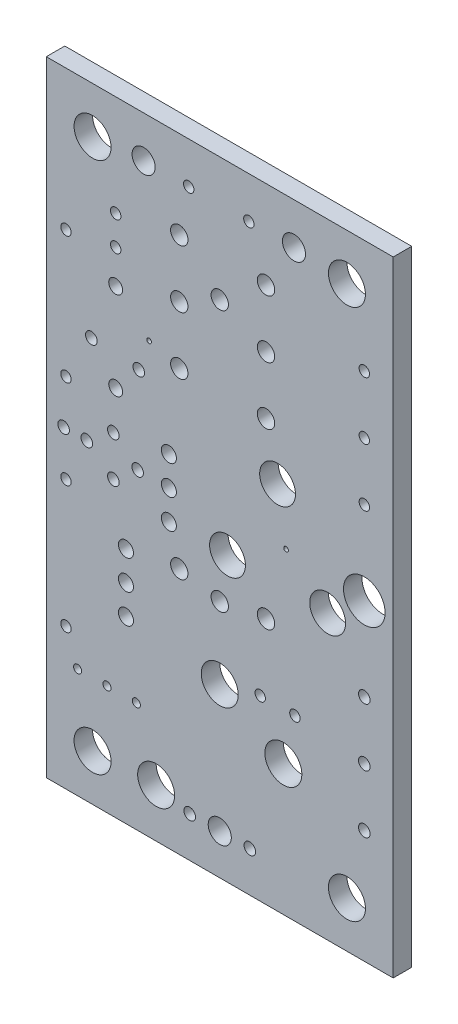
ISO-10303-21;
HEADER;
FILE_DESCRIPTION(('STEP AP214'),'2;1');
FILE_NAME('part.step','',(''),(''),'','','');
FILE_SCHEMA(('AUTOMOTIVE_DESIGN { 1 0 10303 214 1 1 1 1 }'));
ENDSEC;
DATA;
#1=APPLICATION_CONTEXT('core data for automotive mechanical design processes');
#2=APPLICATION_PROTOCOL_DEFINITION('international standard','automotive_design',2000,#1);
#3=PRODUCT_CONTEXT('',#1,'mechanical');
#4=PRODUCT('Part','Part','',(#3));
#5=PRODUCT_RELATED_PRODUCT_CATEGORY('part','',(#4));
#6=PRODUCT_DEFINITION_FORMATION('','',#4);
#7=PRODUCT_DEFINITION_CONTEXT('part definition',#1,'design');
#8=PRODUCT_DEFINITION('design','',#6,#7);
#9=PRODUCT_DEFINITION_SHAPE('','',#8);
#10=(LENGTH_UNIT() NAMED_UNIT(*) SI_UNIT(.MILLI.,.METRE.));
#11=(NAMED_UNIT(*) PLANE_ANGLE_UNIT() SI_UNIT($,.RADIAN.));
#12=(NAMED_UNIT(*) SI_UNIT($,.STERADIAN.) SOLID_ANGLE_UNIT());
#13=UNCERTAINTY_MEASURE_WITH_UNIT(LENGTH_MEASURE(1.E-05),#10,'distance_accuracy_value','');
#14=(GEOMETRIC_REPRESENTATION_CONTEXT(3) GLOBAL_UNCERTAINTY_ASSIGNED_CONTEXT((#13)) GLOBAL_UNIT_ASSIGNED_CONTEXT((#10,
#11,#12)) REPRESENTATION_CONTEXT('',''));
#15=CARTESIAN_POINT('',(0.,0.,0.));
#16=DIRECTION('',(0.,0.,1.));
#17=DIRECTION('',(1.,0.,0.));
#18=AXIS2_PLACEMENT_3D('',#15,#16,#17);
#19=CARTESIAN_POINT('',(0.,0.,1.6));
#20=DIRECTION('',(0.,0.,1.));
#21=DIRECTION('',(1.,0.,0.));
#22=AXIS2_PLACEMENT_3D('',#19,#20,#21);
#23=PLANE('',#22);
#24=CARTESIAN_POINT('',(15.00028,3.50012,1.6));
#25=DIRECTION('',(0.,0.,1.));
#26=DIRECTION('',(1.,0.,0.));
#27=AXIS2_PLACEMENT_3D('',#24,#25,#26);
#28=CIRCLE('',#27,1.);
#29=CARTESIAN_POINT('',(16.00028,3.50012,1.6));
#30=VERTEX_POINT('',#29);
#31=EDGE_CURVE('E473',#30,#30,#28,.T.);
#32=ORIENTED_EDGE('',*,*,#31,.F.);
#33=EDGE_LOOP('',(#32));
#34=FACE_BOUND('',#33,.T.);
#35=CARTESIAN_POINT('',(4.,4.,1.6));
#36=DIRECTION('',(0.,0.,1.));
#37=DIRECTION('',(-1.,0.,0.));
#38=AXIS2_PLACEMENT_3D('',#35,#36,#37);
#39=CIRCLE('',#38,1.6);
#40=CARTESIAN_POINT('',(2.4,4.,1.6));
#41=VERTEX_POINT('',#40);
#42=EDGE_CURVE('E461',#41,#41,#39,.T.);
#43=ORIENTED_EDGE('',*,*,#42,.F.);
#44=EDGE_LOOP('',(#43));
#45=FACE_BOUND('',#44,.T.);
#46=CARTESIAN_POINT('',(26.,50.,1.6));
#47=DIRECTION('',(0.,0.,1.));
#48=DIRECTION('',(-1.,0.,0.));
#49=AXIS2_PLACEMENT_3D('',#46,#47,#48);
#50=CIRCLE('',#49,1.6);
#51=CARTESIAN_POINT('',(24.4,50.,1.6));
#52=VERTEX_POINT('',#51);
#53=EDGE_CURVE('E449',#52,#52,#50,.T.);
#54=ORIENTED_EDGE('',*,*,#53,.F.);
#55=EDGE_LOOP('',(#54));
#56=FACE_BOUND('',#55,.T.);
#57=CARTESIAN_POINT('',(9.4996,4.20243,1.6));
#58=DIRECTION('',(0.,0.,1.));
#59=DIRECTION('',(1.,0.,0.));
#60=AXIS2_PLACEMENT_3D('',#57,#58,#59);
#61=CIRCLE('',#60,1.6);
#62=CARTESIAN_POINT('',(11.0996,4.20243,1.6));
#63=VERTEX_POINT('',#62);
#64=EDGE_CURVE('E437',#63,#63,#61,.T.);
#65=ORIENTED_EDGE('',*,*,#64,.F.);
#66=EDGE_LOOP('',(#65));
#67=FACE_BOUND('',#66,.T.);
#68=CARTESIAN_POINT('',(18.50009,15.40002,1.6));
#69=DIRECTION('',(0.,0.,1.));
#70=DIRECTION('',(1.,0.,0.));
#71=AXIS2_PLACEMENT_3D('',#68,#69,#70);
#72=CIRCLE('',#71,0.449999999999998);
#73=CARTESIAN_POINT('',(18.95009,15.40002,1.6));
#74=VERTEX_POINT('',#73);
#75=EDGE_CURVE('E425',#74,#74,#72,.T.);
#76=ORIENTED_EDGE('',*,*,#75,.F.);
#77=EDGE_LOOP('',(#76));
#78=FACE_BOUND('',#77,.T.);
#79=CARTESIAN_POINT('',(3.89763,34.88182,1.6));
#80=DIRECTION('',(0.,0.,1.));
#81=DIRECTION('',(1.,0.,0.));
#82=AXIS2_PLACEMENT_3D('',#79,#80,#81);
#83=CIRCLE('',#82,0.5);
#84=CARTESIAN_POINT('',(4.39763,34.88182,1.6));
#85=VERTEX_POINT('',#84);
#86=EDGE_CURVE('E413',#85,#85,#83,.T.);
#87=ORIENTED_EDGE('',*,*,#86,.F.);
#88=EDGE_LOOP('',(#87));
#89=FACE_BOUND('',#88,.T.);
#90=CARTESIAN_POINT('',(6.00329,42.72788,1.6));
#91=DIRECTION('',(0.,0.,1.));
#92=DIRECTION('',(1.,0.,0.));
#93=AXIS2_PLACEMENT_3D('',#90,#91,#92);
#94=CIRCLE('',#93,0.45);
#95=CARTESIAN_POINT('',(6.45329,42.72788,1.6));
#96=VERTEX_POINT('',#95);
#97=EDGE_CURVE('E401',#96,#96,#94,.T.);
#98=ORIENTED_EDGE('',*,*,#97,.F.);
#99=EDGE_LOOP('',(#98));
#100=FACE_BOUND('',#99,.T.);
#101=CARTESIAN_POINT('',(5.24891,9.4996,1.6));
#102=DIRECTION('',(0.,0.,1.));
#103=DIRECTION('',(1.,0.,0.));
#104=AXIS2_PLACEMENT_3D('',#101,#102,#103);
#105=CIRCLE('',#104,0.35);
#106=CARTESIAN_POINT('',(5.59891,9.4996,1.6));
#107=VERTEX_POINT('',#106);
#108=EDGE_CURVE('E389',#107,#107,#105,.T.);
#109=ORIENTED_EDGE('',*,*,#108,.F.);
#110=EDGE_LOOP('',(#109));
#111=FACE_BOUND('',#110,.T.);
#112=CARTESIAN_POINT('',(5.99948,32.18942,1.6));
#113=DIRECTION('',(0.,0.,1.));
#114=DIRECTION('',(1.,0.,0.));
#115=AXIS2_PLACEMENT_3D('',#112,#113,#114);
#116=CIRCLE('',#115,0.600000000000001);
#117=CARTESIAN_POINT('',(6.59948,32.18942,1.6));
#118=VERTEX_POINT('',#117);
#119=EDGE_CURVE('E377',#118,#118,#116,.T.);
#120=ORIENTED_EDGE('',*,*,#119,.F.);
#121=EDGE_LOOP('',(#120));
#122=FACE_BOUND('',#121,.T.);
#123=CARTESIAN_POINT('',(19.00047,36.40074,1.6));
#124=DIRECTION('',(0.,0.,1.));
#125=DIRECTION('',(1.,0.,0.));
#126=AXIS2_PLACEMENT_3D('',#123,#124,#125);
#127=CIRCLE('',#126,0.750000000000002);
#128=CARTESIAN_POINT('',(19.75047,36.40074,1.6));
#129=VERTEX_POINT('',#128);
#130=EDGE_CURVE('E365',#129,#129,#127,.T.);
#131=ORIENTED_EDGE('',*,*,#130,.F.);
#132=EDGE_LOOP('',(#131));
#133=FACE_BOUND('',#132,.T.);
#134=CARTESIAN_POINT('',(6.00329,45.26788,1.6));
#135=DIRECTION('',(0.,0.,1.));
#136=DIRECTION('',(1.,0.,0.));
#137=AXIS2_PLACEMENT_3D('',#134,#135,#136);
#138=CIRCLE('',#137,0.45);
#139=CARTESIAN_POINT('',(6.45329,45.26788,1.6));
#140=VERTEX_POINT('',#139);
#141=EDGE_CURVE('E353',#140,#140,#138,.T.);
#142=ORIENTED_EDGE('',*,*,#141,.F.);
#143=EDGE_LOOP('',(#142));
#144=FACE_BOUND('',#143,.T.);
#145=CARTESIAN_POINT('',(20.73656,27.4828,1.6));
#146=DIRECTION('',(0.,0.,1.));
#147=DIRECTION('',(1.,0.,0.));
#148=AXIS2_PLACEMENT_3D('',#145,#146,#147);
#149=CIRCLE('',#148,0.199999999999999);
#150=CARTESIAN_POINT('',(20.93656,27.4828,1.6));
#151=VERTEX_POINT('',#150);
#152=EDGE_CURVE('E341',#151,#151,#149,.T.);
#153=ORIENTED_EDGE('',*,*,#152,.F.);
#154=EDGE_LOOP('',(#153));
#155=FACE_BOUND('',#154,.T.);
#156=CARTESIAN_POINT('',(1.70053,23.20036,1.6));
#157=DIRECTION('',(0.,0.,1.));
#158=DIRECTION('',(1.,0.,0.));
#159=AXIS2_PLACEMENT_3D('',#156,#157,#158);
#160=CIRCLE('',#159,0.45);
#161=CARTESIAN_POINT('',(2.15053,23.20036,1.6));
#162=VERTEX_POINT('',#161);
#163=EDGE_CURVE('E329',#162,#162,#160,.T.);
#164=ORIENTED_EDGE('',*,*,#163,.F.);
#165=EDGE_LOOP('',(#164));
#166=FACE_BOUND('',#165,.T.);
#167=CARTESIAN_POINT('',(6.88975,20.58924,1.6));
#168=DIRECTION('',(0.,0.,1.));
#169=DIRECTION('',(1.,0.,0.));
#170=AXIS2_PLACEMENT_3D('',#167,#168,#169);
#171=CIRCLE('',#170,0.65);
#172=CARTESIAN_POINT('',(7.53975,20.58924,1.6));
#173=VERTEX_POINT('',#172);
#174=EDGE_CURVE('E317',#173,#173,#171,.T.);
#175=ORIENTED_EDGE('',*,*,#174,.F.);
#176=EDGE_LOOP('',(#175));
#177=FACE_BOUND('',#176,.T.);
#178=CARTESIAN_POINT('',(21.41711,50.41646,1.6));
#179=DIRECTION('',(0.,0.,1.));
#180=DIRECTION('',(1.,0.,0.));
#181=AXIS2_PLACEMENT_3D('',#178,#179,#180);
#182=CIRCLE('',#181,1.);
#183=CARTESIAN_POINT('',(22.41711,50.41646,1.6));
#184=VERTEX_POINT('',#183);
#185=EDGE_CURVE('E305',#184,#184,#182,.T.);
#186=ORIENTED_EDGE('',*,*,#185,.F.);
#187=EDGE_LOOP('',(#186));
#188=FACE_BOUND('',#187,.T.);
#189=CARTESIAN_POINT('',(20.00058,32.0005799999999,1.6));
#190=DIRECTION('',(0.,0.,1.));
#191=DIRECTION('',(1.,0.,0.));
#192=AXIS2_PLACEMENT_3D('',#189,#190,#191);
#193=CIRCLE('',#192,1.55);
#194=CARTESIAN_POINT('',(21.55058,32.0005799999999,1.6));
#195=VERTEX_POINT('',#194);
#196=EDGE_CURVE('E293',#195,#195,#193,.T.);
#197=ORIENTED_EDGE('',*,*,#196,.F.);
#198=EDGE_LOOP('',(#197));
#199=FACE_BOUND('',#198,.T.);
#200=CARTESIAN_POINT('',(15.67058,24.5005799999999,1.6));
#201=DIRECTION('',(0.,0.,1.));
#202=DIRECTION('',(1.,0.,0.));
#203=AXIS2_PLACEMENT_3D('',#200,#201,#202);
#204=CIRCLE('',#203,1.55);
#205=CARTESIAN_POINT('',(17.22058,24.5005799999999,1.6));
#206=VERTEX_POINT('',#205);
#207=EDGE_CURVE('E281',#206,#206,#204,.T.);
#208=ORIENTED_EDGE('',*,*,#207,.F.);
#209=EDGE_LOOP('',(#208));
#210=FACE_BOUND('',#209,.T.);
#211=CARTESIAN_POINT('',(14.9987,14.50213,1.6));
#212=DIRECTION('',(0.,0.,1.));
#213=DIRECTION('',(1.,0.,0.));
#214=AXIS2_PLACEMENT_3D('',#211,#212,#213);
#215=CIRCLE('',#214,1.6);
#216=CARTESIAN_POINT('',(16.5987,14.50213,1.6));
#217=VERTEX_POINT('',#216);
#218=EDGE_CURVE('E269',#217,#217,#215,.T.);
#219=ORIENTED_EDGE('',*,*,#218,.F.);
#220=EDGE_LOOP('',(#219));
#221=FACE_BOUND('',#220,.T.);
#222=CARTESIAN_POINT('',(1.70053,12.19962,1.6));
#223=DIRECTION('',(0.,0.,1.));
#224=DIRECTION('',(1.,0.,0.));
#225=AXIS2_PLACEMENT_3D('',#222,#223,#224);
#226=CIRCLE('',#225,0.45);
#227=CARTESIAN_POINT('',(2.15053,12.19962,1.6));
#228=VERTEX_POINT('',#227);
#229=EDGE_CURVE('E257',#228,#228,#226,.T.);
#230=ORIENTED_EDGE('',*,*,#229,.F.);
#231=EDGE_LOOP('',(#230));
#232=FACE_BOUND('',#231,.T.);
#233=CARTESIAN_POINT('',(27.4993100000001,34.20108,1.6));
#234=DIRECTION('',(0.,0.,1.));
#235=DIRECTION('',(1.,0.,0.));
#236=AXIS2_PLACEMENT_3D('',#233,#234,#235);
#237=CIRCLE('',#236,0.449999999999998);
#238=CARTESIAN_POINT('',(27.9493100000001,34.20108,1.6));
#239=VERTEX_POINT('',#238);
#240=EDGE_CURVE('E245',#239,#239,#237,.T.);
#241=ORIENTED_EDGE('',*,*,#240,.F.);
#242=EDGE_LOOP('',(#241));
#243=FACE_BOUND('',#242,.T.);
#244=CARTESIAN_POINT('',(6.88975,15.50924,1.6));
#245=DIRECTION('',(0.,0.,1.));
#246=DIRECTION('',(1.,0.,0.));
#247=AXIS2_PLACEMENT_3D('',#244,#245,#246);
#248=CIRCLE('',#247,0.65);
#249=CARTESIAN_POINT('',(7.53975,15.50924,1.6));
#250=VERTEX_POINT('',#249);
#251=EDGE_CURVE('E233',#250,#250,#248,.T.);
#252=ORIENTED_EDGE('',*,*,#251,.F.);
#253=EDGE_LOOP('',(#252));
#254=FACE_BOUND('',#253,.T.);
#255=CARTESIAN_POINT('',(27.4993100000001,39.20108,1.6));
#256=DIRECTION('',(0.,0.,1.));
#257=DIRECTION('',(1.,0.,0.));
#258=AXIS2_PLACEMENT_3D('',#255,#256,#257);
#259=CIRCLE('',#258,0.449999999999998);
#260=CARTESIAN_POINT('',(27.9493100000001,39.20108,1.6));
#261=VERTEX_POINT('',#260);
#262=EDGE_CURVE('E221',#261,#261,#259,.T.);
#263=ORIENTED_EDGE('',*,*,#262,.F.);
#264=EDGE_LOOP('',(#263));
#265=FACE_BOUND('',#264,.T.);
#266=CARTESIAN_POINT('',(27.50058,19.80058,1.6));
#267=DIRECTION('',(0.,0.,1.));
#268=DIRECTION('',(1.,0.,0.));
#269=AXIS2_PLACEMENT_3D('',#266,#267,#268);
#270=CIRCLE('',#269,0.499999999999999);
#271=CARTESIAN_POINT('',(28.00058,19.80058,1.6));
#272=VERTEX_POINT('',#271);
#273=EDGE_CURVE('E209',#272,#272,#270,.T.);
#274=ORIENTED_EDGE('',*,*,#273,.F.);
#275=EDGE_LOOP('',(#274));
#276=FACE_BOUND('',#275,.T.);
#277=CARTESIAN_POINT('',(11.50047,46.4007399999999,1.6));
#278=DIRECTION('',(0.,0.,1.));
#279=DIRECTION('',(1.,0.,0.));
#280=AXIS2_PLACEMENT_3D('',#277,#278,#279);
#281=CIRCLE('',#280,0.750000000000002);
#282=CARTESIAN_POINT('',(12.25047,46.4007399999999,1.6));
#283=VERTEX_POINT('',#282);
#284=EDGE_CURVE('E197',#283,#283,#281,.T.);
#285=ORIENTED_EDGE('',*,*,#284,.F.);
#286=EDGE_LOOP('',(#285));
#287=FACE_BOUND('',#286,.T.);
#288=CARTESIAN_POINT('',(19.00047,46.40074,1.6));
#289=DIRECTION('',(0.,0.,1.));
#290=DIRECTION('',(1.,0.,0.));
#291=AXIS2_PLACEMENT_3D('',#288,#289,#290);
#292=CIRCLE('',#291,0.750000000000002);
#293=CARTESIAN_POINT('',(19.75047,46.40074,1.6));
#294=VERTEX_POINT('',#293);
#295=EDGE_CURVE('E185',#294,#294,#292,.T.);
#296=ORIENTED_EDGE('',*,*,#295,.F.);
#297=EDGE_LOOP('',(#296));
#298=FACE_BOUND('',#297,.T.);
#299=CARTESIAN_POINT('',(19.00047,41.40074,1.6));
#300=DIRECTION('',(0.,0.,1.));
#301=DIRECTION('',(1.,0.,0.));
#302=AXIS2_PLACEMENT_3D('',#299,#300,#301);
#303=CIRCLE('',#302,0.750000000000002);
#304=CARTESIAN_POINT('',(19.75047,41.40074,1.6));
#305=VERTEX_POINT('',#304);
#306=EDGE_CURVE('E173',#305,#305,#303,.T.);
#307=ORIENTED_EDGE('',*,*,#306,.F.);
#308=EDGE_LOOP('',(#307));
#309=FACE_BOUND('',#308,.T.);
#310=CARTESIAN_POINT('',(10.60069,29.5402,1.6));
#311=DIRECTION('',(0.,0.,1.));
#312=DIRECTION('',(1.,0.,0.));
#313=AXIS2_PLACEMENT_3D('',#310,#311,#312);
#314=CIRCLE('',#313,0.649999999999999);
#315=CARTESIAN_POINT('',(11.25069,29.5402,1.6));
#316=VERTEX_POINT('',#315);
#317=EDGE_CURVE('E161',#316,#316,#314,.T.);
#318=ORIENTED_EDGE('',*,*,#317,.F.);
#319=EDGE_LOOP('',(#318));
#320=FACE_BOUND('',#319,.T.);
#321=CARTESIAN_POINT('',(3.49882000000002,27.00026,1.6));
#322=DIRECTION('',(0.,0.,1.));
#323=DIRECTION('',(1.,0.,0.));
#324=AXIS2_PLACEMENT_3D('',#321,#322,#323);
#325=CIRCLE('',#324,0.500000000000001);
#326=CARTESIAN_POINT('',(3.99882000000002,27.00026,1.6));
#327=VERTEX_POINT('',#326);
#328=EDGE_CURVE('E149',#327,#327,#325,.T.);
#329=ORIENTED_EDGE('',*,*,#328,.F.);
#330=EDGE_LOOP('',(#329));
#331=FACE_BOUND('',#330,.T.);
#332=CARTESIAN_POINT('',(5.79882000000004,25.25026,1.6));
#333=DIRECTION('',(0.,0.,1.));
#334=DIRECTION('',(1.,0.,0.));
#335=AXIS2_PLACEMENT_3D('',#332,#333,#334);
#336=CIRCLE('',#335,0.500000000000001);
#337=CARTESIAN_POINT('',(6.29882000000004,25.25026,1.6));
#338=VERTEX_POINT('',#337);
#339=EDGE_CURVE('E137',#338,#338,#336,.T.);
#340=ORIENTED_EDGE('',*,*,#339,.F.);
#341=EDGE_LOOP('',(#340));
#342=FACE_BOUND('',#341,.T.);
#343=CARTESIAN_POINT('',(6.88975000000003,18.04924,1.6));
#344=DIRECTION('',(0.,0.,1.));
#345=DIRECTION('',(1.,0.,0.));
#346=AXIS2_PLACEMENT_3D('',#343,#344,#345);
#347=CIRCLE('',#346,0.65);
#348=CARTESIAN_POINT('',(7.53975000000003,18.04924,1.6));
#349=VERTEX_POINT('',#348);
#350=EDGE_CURVE('E125',#349,#349,#347,.T.);
#351=ORIENTED_EDGE('',*,*,#350,.F.);
#352=EDGE_LOOP('',(#351));
#353=FACE_BOUND('',#352,.T.);
#354=CARTESIAN_POINT('',(5.79882,28.75026,1.6));
#355=DIRECTION('',(0.,0.,1.));
#356=DIRECTION('',(1.,0.,0.));
#357=AXIS2_PLACEMENT_3D('',#354,#355,#356);
#358=CIRCLE('',#357,0.500000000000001);
#359=CARTESIAN_POINT('',(6.29882,28.75026,1.6));
#360=VERTEX_POINT('',#359);
#361=EDGE_CURVE('E104',#360,#360,#358,.T.);
#362=ORIENTED_EDGE('',*,*,#361,.F.);
#363=EDGE_LOOP('',(#362));
#364=FACE_BOUND('',#363,.T.);
#365=DIRECTION('',(0.,-1.,0.));
#366=VECTOR('',#365,1.);
#367=CARTESIAN_POINT('',(0.,54.,1.6));
#368=LINE('',#367,#366);
#369=CARTESIAN_POINT('',(0.,54.,1.6));
#370=VERTEX_POINT('',#369);
#371=CARTESIAN_POINT('',(0.,0.,1.6));
#372=VERTEX_POINT('',#371);
#373=EDGE_CURVE('E89',#370,#372,#368,.T.);
#374=ORIENTED_EDGE('',*,*,#373,.T.);
#375=DIRECTION('',(1.,0.,0.));
#376=VECTOR('',#375,1.);
#377=CARTESIAN_POINT('',(0.,0.,1.6));
#378=LINE('',#377,#376);
#379=CARTESIAN_POINT('',(30.,0.,1.6));
#380=VERTEX_POINT('',#379);
#381=EDGE_CURVE('E84',#372,#380,#378,.T.);
#382=ORIENTED_EDGE('',*,*,#381,.T.);
#383=DIRECTION('',(0.,1.,0.));
#384=VECTOR('',#383,1.);
#385=CARTESIAN_POINT('',(30.,54.,1.6));
#386=LINE('',#385,#384);
#387=CARTESIAN_POINT('',(30.,54.,1.6));
#388=VERTEX_POINT('',#387);
#389=EDGE_CURVE('E87',#380,#388,#386,.T.);
#390=ORIENTED_EDGE('',*,*,#389,.T.);
#391=DIRECTION('',(-1.,0.,0.));
#392=VECTOR('',#391,1.);
#393=CARTESIAN_POINT('',(0.,54.,1.6));
#394=LINE('',#393,#392);
#395=EDGE_CURVE('E54',#388,#370,#394,.T.);
#396=ORIENTED_EDGE('',*,*,#395,.T.);
#397=EDGE_LOOP('',(#374,#382,#390,#396));
#398=FACE_BOUND('',#397,.T.);
#399=CARTESIAN_POINT('',(1.70053,30.8991,1.6));
#400=DIRECTION('',(0.,0.,1.));
#401=DIRECTION('',(1.,0.,0.));
#402=AXIS2_PLACEMENT_3D('',#399,#400,#401);
#403=CIRCLE('',#402,0.45);
#404=CARTESIAN_POINT('',(2.15053,30.8991,1.6));
#405=VERTEX_POINT('',#404);
#406=EDGE_CURVE('E119',#405,#405,#403,.T.);
#407=ORIENTED_EDGE('',*,*,#406,.F.);
#408=EDGE_LOOP('',(#407));
#409=FACE_BOUND('',#408,.T.);
#410=CARTESIAN_POINT('',(10.60069,27.0002,1.6));
#411=DIRECTION('',(0.,0.,1.));
#412=DIRECTION('',(1.,0.,0.));
#413=AXIS2_PLACEMENT_3D('',#410,#411,#412);
#414=CIRCLE('',#413,0.649999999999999);
#415=CARTESIAN_POINT('',(11.25069,27.0002,1.6));
#416=VERTEX_POINT('',#415);
#417=EDGE_CURVE('E131',#416,#416,#414,.T.);
#418=ORIENTED_EDGE('',*,*,#417,.F.);
#419=EDGE_LOOP('',(#418));
#420=FACE_BOUND('',#419,.T.);
#421=CARTESIAN_POINT('',(7.89882000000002,27.00026,1.6));
#422=DIRECTION('',(0.,0.,1.));
#423=DIRECTION('',(1.,0.,0.));
#424=AXIS2_PLACEMENT_3D('',#421,#422,#423);
#425=CIRCLE('',#424,0.500000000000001);
#426=CARTESIAN_POINT('',(8.39882000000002,27.00026,1.6));
#427=VERTEX_POINT('',#426);
#428=EDGE_CURVE('E143',#427,#427,#425,.T.);
#429=ORIENTED_EDGE('',*,*,#428,.F.);
#430=EDGE_LOOP('',(#429));
#431=FACE_BOUND('',#430,.T.);
#432=CARTESIAN_POINT('',(1.49882000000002,27.00026,1.6));
#433=DIRECTION('',(0.,0.,1.));
#434=DIRECTION('',(1.,0.,0.));
#435=AXIS2_PLACEMENT_3D('',#432,#433,#434);
#436=CIRCLE('',#435,0.500000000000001);
#437=CARTESIAN_POINT('',(1.99882000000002,27.00026,1.6));
#438=VERTEX_POINT('',#437);
#439=EDGE_CURVE('E155',#438,#438,#436,.T.);
#440=ORIENTED_EDGE('',*,*,#439,.F.);
#441=EDGE_LOOP('',(#440));
#442=FACE_BOUND('',#441,.T.);
#443=CARTESIAN_POINT('',(14.99997,20.69973,1.6));
#444=DIRECTION('',(0.,0.,1.));
#445=DIRECTION('',(1.,0.,0.));
#446=AXIS2_PLACEMENT_3D('',#443,#444,#445);
#447=CIRCLE('',#446,0.750000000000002);
#448=CARTESIAN_POINT('',(15.74997,20.69973,1.6));
#449=VERTEX_POINT('',#448);
#450=EDGE_CURVE('E167',#449,#449,#447,.T.);
#451=ORIENTED_EDGE('',*,*,#450,.F.);
#452=EDGE_LOOP('',(#451));
#453=FACE_BOUND('',#452,.T.);
#454=CARTESIAN_POINT('',(14.9999699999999,43.29973,1.6));
#455=DIRECTION('',(0.,0.,1.));
#456=DIRECTION('',(1.,0.,0.));
#457=AXIS2_PLACEMENT_3D('',#454,#455,#456);
#458=CIRCLE('',#457,0.75);
#459=CARTESIAN_POINT('',(15.7499699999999,43.29973,1.6));
#460=VERTEX_POINT('',#459);
#461=EDGE_CURVE('E179',#460,#460,#458,.T.);
#462=ORIENTED_EDGE('',*,*,#461,.F.);
#463=EDGE_LOOP('',(#462));
#464=FACE_BOUND('',#463,.T.);
#465=CARTESIAN_POINT('',(11.50047,41.4007399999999,1.6));
#466=DIRECTION('',(0.,0.,1.));
#467=DIRECTION('',(1.,0.,0.));
#468=AXIS2_PLACEMENT_3D('',#465,#466,#467);
#469=CIRCLE('',#468,0.750000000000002);
#470=CARTESIAN_POINT('',(12.25047,41.4007399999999,1.6));
#471=VERTEX_POINT('',#470);
#472=EDGE_CURVE('E191',#471,#471,#469,.T.);
#473=ORIENTED_EDGE('',*,*,#472,.F.);
#474=EDGE_LOOP('',(#473));
#475=FACE_BOUND('',#474,.T.);
#476=CARTESIAN_POINT('',(11.50047,36.4007399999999,1.6));
#477=DIRECTION('',(0.,0.,1.));
#478=DIRECTION('',(1.,0.,0.));
#479=AXIS2_PLACEMENT_3D('',#476,#477,#478);
#480=CIRCLE('',#479,0.750000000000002);
#481=CARTESIAN_POINT('',(12.25047,36.4007399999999,1.6));
#482=VERTEX_POINT('',#481);
#483=EDGE_CURVE('E203',#482,#482,#480,.T.);
#484=ORIENTED_EDGE('',*,*,#483,.F.);
#485=EDGE_LOOP('',(#484));
#486=FACE_BOUND('',#485,.T.);
#487=CARTESIAN_POINT('',(7.78891,9.4996,1.6));
#488=DIRECTION('',(0.,0.,1.));
#489=DIRECTION('',(1.,0.,0.));
#490=AXIS2_PLACEMENT_3D('',#487,#488,#489);
#491=CIRCLE('',#490,0.350000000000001);
#492=CARTESIAN_POINT('',(8.13891,9.4996,1.6));
#493=VERTEX_POINT('',#492);
#494=EDGE_CURVE('E215',#493,#493,#491,.T.);
#495=ORIENTED_EDGE('',*,*,#494,.F.);
#496=EDGE_LOOP('',(#495));
#497=FACE_BOUND('',#496,.T.);
#498=CARTESIAN_POINT('',(27.50058,9.79932,1.6));
#499=DIRECTION('',(0.,0.,1.));
#500=DIRECTION('',(1.,0.,0.));
#501=AXIS2_PLACEMENT_3D('',#498,#499,#500);
#502=CIRCLE('',#501,0.499999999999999);
#503=CARTESIAN_POINT('',(28.00058,9.79932,1.6));
#504=VERTEX_POINT('',#503);
#505=EDGE_CURVE('E227',#504,#504,#502,.T.);
#506=ORIENTED_EDGE('',*,*,#505,.F.);
#507=EDGE_LOOP('',(#506));
#508=FACE_BOUND('',#507,.T.);
#509=CARTESIAN_POINT('',(2.70891,9.49959999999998,1.6));
#510=DIRECTION('',(0.,0.,1.));
#511=DIRECTION('',(1.,0.,0.));
#512=AXIS2_PLACEMENT_3D('',#509,#510,#511);
#513=CIRCLE('',#512,0.35);
#514=CARTESIAN_POINT('',(3.05891,9.49959999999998,1.6));
#515=VERTEX_POINT('',#514);
#516=EDGE_CURVE('E239',#515,#515,#513,.T.);
#517=ORIENTED_EDGE('',*,*,#516,.F.);
#518=EDGE_LOOP('',(#517));
#519=FACE_BOUND('',#518,.T.);
#520=CARTESIAN_POINT('',(27.50058,27.00058,1.6));
#521=DIRECTION('',(0.,0.,1.));
#522=DIRECTION('',(1.,0.,0.));
#523=AXIS2_PLACEMENT_3D('',#520,#521,#522);
#524=CIRCLE('',#523,1.8);
#525=CARTESIAN_POINT('',(29.30058,27.00058,1.6));
#526=VERTEX_POINT('',#525);
#527=EDGE_CURVE('E251',#526,#526,#524,.T.);
#528=ORIENTED_EDGE('',*,*,#527,.F.);
#529=EDGE_LOOP('',(#528));
#530=FACE_BOUND('',#529,.T.);
#531=CARTESIAN_POINT('',(20.49907,11.303,1.6));
#532=DIRECTION('',(0.,0.,1.));
#533=DIRECTION('',(1.,0.,0.));
#534=AXIS2_PLACEMENT_3D('',#531,#532,#533);
#535=CIRCLE('',#534,1.6);
#536=CARTESIAN_POINT('',(22.09907,11.303,1.6));
#537=VERTEX_POINT('',#536);
#538=EDGE_CURVE('E263',#537,#537,#535,.T.);
#539=ORIENTED_EDGE('',*,*,#538,.F.);
#540=EDGE_LOOP('',(#539));
#541=FACE_BOUND('',#540,.T.);
#542=CARTESIAN_POINT('',(24.33058,24.50058,1.6));
#543=DIRECTION('',(0.,0.,1.));
#544=DIRECTION('',(1.,0.,0.));
#545=AXIS2_PLACEMENT_3D('',#542,#543,#544);
#546=CIRCLE('',#545,1.55);
#547=CARTESIAN_POINT('',(25.88058,24.50058,1.6));
#548=VERTEX_POINT('',#547);
#549=EDGE_CURVE('E275',#548,#548,#546,.T.);
#550=ORIENTED_EDGE('',*,*,#549,.F.);
#551=EDGE_LOOP('',(#550));
#552=FACE_BOUND('',#551,.T.);
#553=CARTESIAN_POINT('',(5.99947999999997,39.80942,1.6));
#554=DIRECTION('',(0.,0.,1.));
#555=DIRECTION('',(1.,0.,0.));
#556=AXIS2_PLACEMENT_3D('',#553,#554,#555);
#557=CIRCLE('',#556,0.600000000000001);
#558=CARTESIAN_POINT('',(6.59947999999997,39.80942,1.6));
#559=VERTEX_POINT('',#558);
#560=EDGE_CURVE('E287',#559,#559,#557,.T.);
#561=ORIENTED_EDGE('',*,*,#560,.F.);
#562=EDGE_LOOP('',(#561));
#563=FACE_BOUND('',#562,.T.);
#564=CARTESIAN_POINT('',(12.31711,50.41646,1.6));
#565=DIRECTION('',(0.,0.,1.));
#566=DIRECTION('',(1.,0.,0.));
#567=AXIS2_PLACEMENT_3D('',#564,#565,#566);
#568=CIRCLE('',#567,0.449999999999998);
#569=CARTESIAN_POINT('',(12.76711,50.41646,1.6));
#570=VERTEX_POINT('',#569);
#571=EDGE_CURVE('E299',#570,#570,#568,.T.);
#572=ORIENTED_EDGE('',*,*,#571,.F.);
#573=EDGE_LOOP('',(#572));
#574=FACE_BOUND('',#573,.T.);
#575=CARTESIAN_POINT('',(8.41711,50.4164599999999,1.6));
#576=DIRECTION('',(0.,0.,1.));
#577=DIRECTION('',(1.,0.,0.));
#578=AXIS2_PLACEMENT_3D('',#575,#576,#577);
#579=CIRCLE('',#578,1.);
#580=CARTESIAN_POINT('',(9.41711,50.4164599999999,1.6));
#581=VERTEX_POINT('',#580);
#582=EDGE_CURVE('E311',#581,#581,#579,.T.);
#583=ORIENTED_EDGE('',*,*,#582,.F.);
#584=EDGE_LOOP('',(#583));
#585=FACE_BOUND('',#584,.T.);
#586=CARTESIAN_POINT('',(10.60069,24.4602,1.6));
#587=DIRECTION('',(0.,0.,1.));
#588=DIRECTION('',(1.,0.,0.));
#589=AXIS2_PLACEMENT_3D('',#586,#587,#588);
#590=CIRCLE('',#589,0.649999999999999);
#591=CARTESIAN_POINT('',(11.25069,24.4602,1.6));
#592=VERTEX_POINT('',#591);
#593=EDGE_CURVE('E323',#592,#592,#590,.T.);
#594=ORIENTED_EDGE('',*,*,#593,.F.);
#595=EDGE_LOOP('',(#594));
#596=FACE_BOUND('',#595,.T.);
#597=CARTESIAN_POINT('',(27.50058,14.80058,1.6));
#598=DIRECTION('',(0.,0.,1.));
#599=DIRECTION('',(1.,0.,0.));
#600=AXIS2_PLACEMENT_3D('',#597,#598,#599);
#601=CIRCLE('',#600,0.499999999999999);
#602=CARTESIAN_POINT('',(28.00058,14.80058,1.6));
#603=VERTEX_POINT('',#602);
#604=EDGE_CURVE('E335',#603,#603,#601,.T.);
#605=ORIENTED_EDGE('',*,*,#604,.F.);
#606=EDGE_LOOP('',(#605));
#607=FACE_BOUND('',#606,.T.);
#608=CARTESIAN_POINT('',(8.89508,37.16528,1.6));
#609=DIRECTION('',(0.,0.,1.));
#610=DIRECTION('',(1.,0.,0.));
#611=AXIS2_PLACEMENT_3D('',#608,#609,#610);
#612=CIRCLE('',#611,0.2);
#613=CARTESIAN_POINT('',(9.09508,37.16528,1.6));
#614=VERTEX_POINT('',#613);
#615=EDGE_CURVE('E347',#614,#614,#612,.T.);
#616=ORIENTED_EDGE('',*,*,#615,.F.);
#617=EDGE_LOOP('',(#616));
#618=FACE_BOUND('',#617,.T.);
#619=CARTESIAN_POINT('',(1.70053,41.89984,1.6));
#620=DIRECTION('',(0.,0.,1.));
#621=DIRECTION('',(1.,0.,0.));
#622=AXIS2_PLACEMENT_3D('',#619,#620,#621);
#623=CIRCLE('',#622,0.449999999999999);
#624=CARTESIAN_POINT('',(2.15053,41.89984,1.6));
#625=VERTEX_POINT('',#624);
#626=EDGE_CURVE('E359',#625,#625,#623,.T.);
#627=ORIENTED_EDGE('',*,*,#626,.F.);
#628=EDGE_LOOP('',(#627));
#629=FACE_BOUND('',#628,.T.);
#630=CARTESIAN_POINT('',(27.49931,44.20108,1.6));
#631=DIRECTION('',(0.,0.,1.));
#632=DIRECTION('',(1.,0.,0.));
#633=AXIS2_PLACEMENT_3D('',#630,#631,#632);
#634=CIRCLE('',#633,0.449999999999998);
#635=CARTESIAN_POINT('',(27.94931,44.20108,1.6));
#636=VERTEX_POINT('',#635);
#637=EDGE_CURVE('E371',#636,#636,#634,.T.);
#638=ORIENTED_EDGE('',*,*,#637,.F.);
#639=EDGE_LOOP('',(#638));
#640=FACE_BOUND('',#639,.T.);
#641=CARTESIAN_POINT('',(19.00047,21.3995,1.6));
#642=DIRECTION('',(0.,0.,1.));
#643=DIRECTION('',(1.,0.,0.));
#644=AXIS2_PLACEMENT_3D('',#641,#642,#643);
#645=CIRCLE('',#644,0.750000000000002);
#646=CARTESIAN_POINT('',(19.75047,21.3995,1.6));
#647=VERTEX_POINT('',#646);
#648=EDGE_CURVE('E383',#647,#647,#645,.T.);
#649=ORIENTED_EDGE('',*,*,#648,.F.);
#650=EDGE_LOOP('',(#649));
#651=FACE_BOUND('',#650,.T.);
#652=CARTESIAN_POINT('',(21.49983,15.40002,1.6));
#653=DIRECTION('',(0.,0.,1.));
#654=DIRECTION('',(1.,0.,0.));
#655=AXIS2_PLACEMENT_3D('',#652,#653,#654);
#656=CIRCLE('',#655,0.449999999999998);
#657=CARTESIAN_POINT('',(21.94983,15.40002,1.6));
#658=VERTEX_POINT('',#657);
#659=EDGE_CURVE('E395',#658,#658,#656,.T.);
#660=ORIENTED_EDGE('',*,*,#659,.F.);
#661=EDGE_LOOP('',(#660));
#662=FACE_BOUND('',#661,.T.);
#663=CARTESIAN_POINT('',(17.51711,50.41646,1.6));
#664=DIRECTION('',(0.,0.,1.));
#665=DIRECTION('',(1.,0.,0.));
#666=AXIS2_PLACEMENT_3D('',#663,#664,#665);
#667=CIRCLE('',#666,0.449999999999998);
#668=CARTESIAN_POINT('',(17.96711,50.41646,1.6));
#669=VERTEX_POINT('',#668);
#670=EDGE_CURVE('E407',#669,#669,#667,.T.);
#671=ORIENTED_EDGE('',*,*,#670,.F.);
#672=EDGE_LOOP('',(#671));
#673=FACE_BOUND('',#672,.T.);
#674=CARTESIAN_POINT('',(7.99592,34.55416,1.6));
#675=DIRECTION('',(0.,0.,1.));
#676=DIRECTION('',(1.,0.,0.));
#677=AXIS2_PLACEMENT_3D('',#674,#675,#676);
#678=CIRCLE('',#677,0.500000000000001);
#679=CARTESIAN_POINT('',(8.49592,34.55416,1.6));
#680=VERTEX_POINT('',#679);
#681=EDGE_CURVE('E419',#680,#680,#678,.T.);
#682=ORIENTED_EDGE('',*,*,#681,.F.);
#683=EDGE_LOOP('',(#682));
#684=FACE_BOUND('',#683,.T.);
#685=CARTESIAN_POINT('',(11.49985,21.3995,1.6));
#686=DIRECTION('',(0.,0.,1.));
#687=DIRECTION('',(1.,0.,0.));
#688=AXIS2_PLACEMENT_3D('',#685,#686,#687);
#689=CIRCLE('',#688,0.75);
#690=CARTESIAN_POINT('',(12.24985,21.3995,1.6));
#691=VERTEX_POINT('',#690);
#692=EDGE_CURVE('E431',#691,#691,#689,.T.);
#693=ORIENTED_EDGE('',*,*,#692,.F.);
#694=EDGE_LOOP('',(#693));
#695=FACE_BOUND('',#694,.T.);
#696=CARTESIAN_POINT('',(4.,50.,1.6));
#697=DIRECTION('',(0.,0.,1.));
#698=DIRECTION('',(1.,0.,0.));
#699=AXIS2_PLACEMENT_3D('',#696,#697,#698);
#700=CIRCLE('',#699,1.6);
#701=CARTESIAN_POINT('',(5.6,50.,1.6));
#702=VERTEX_POINT('',#701);
#703=EDGE_CURVE('E443',#702,#702,#700,.T.);
#704=ORIENTED_EDGE('',*,*,#703,.F.);
#705=EDGE_LOOP('',(#704));
#706=FACE_BOUND('',#705,.T.);
#707=CARTESIAN_POINT('',(26.,4.,1.6));
#708=DIRECTION('',(0.,0.,1.));
#709=DIRECTION('',(1.,0.,0.));
#710=AXIS2_PLACEMENT_3D('',#707,#708,#709);
#711=CIRCLE('',#710,1.6);
#712=CARTESIAN_POINT('',(27.6,4.,1.6));
#713=VERTEX_POINT('',#712);
#714=EDGE_CURVE('E455',#713,#713,#711,.T.);
#715=ORIENTED_EDGE('',*,*,#714,.F.);
#716=EDGE_LOOP('',(#715));
#717=FACE_BOUND('',#716,.T.);
#718=CARTESIAN_POINT('',(12.40028,3.50012,1.6));
#719=DIRECTION('',(0.,0.,1.));
#720=DIRECTION('',(1.,0.,0.));
#721=AXIS2_PLACEMENT_3D('',#718,#719,#720);
#722=CIRCLE('',#721,0.500000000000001);
#723=CARTESIAN_POINT('',(12.90028,3.50012,1.6));
#724=VERTEX_POINT('',#723);
#725=EDGE_CURVE('E467',#724,#724,#722,.T.);
#726=ORIENTED_EDGE('',*,*,#725,.F.);
#727=EDGE_LOOP('',(#726));
#728=FACE_BOUND('',#727,.T.);
#729=CARTESIAN_POINT('',(17.60028,3.50012,1.6));
#730=DIRECTION('',(0.,0.,1.));
#731=DIRECTION('',(1.,0.,0.));
#732=AXIS2_PLACEMENT_3D('',#729,#730,#731);
#733=CIRCLE('',#732,0.500000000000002);
#734=CARTESIAN_POINT('',(18.10028,3.50012,1.6));
#735=VERTEX_POINT('',#734);
#736=EDGE_CURVE('E479',#735,#735,#733,.T.);
#737=ORIENTED_EDGE('',*,*,#736,.F.);
#738=EDGE_LOOP('',(#737));
#739=FACE_BOUND('',#738,.T.);
#740=ADVANCED_FACE('F37',(#34,#45,#56,#67,#78,#89,#100,#111,#122,#133,#144,#155,#166,#177,#188,
#199,#210,#221,#232,#243,#254,#265,#276,#287,#298,#309,#320,#331,#342,#353,#364,#398,#409,#420,
#431,#442,#453,#464,#475,#486,#497,#508,#519,#530,#541,#552,#563,#574,#585,#596,#607,#618,#629,
#640,#651,#662,#673,#684,#695,#706,#717,#728,#739),#23,.T.);
#741=CARTESIAN_POINT('',(0.,0.,0.));
#742=DIRECTION('',(0.,0.,1.));
#743=DIRECTION('',(1.,0.,0.));
#744=AXIS2_PLACEMENT_3D('',#741,#742,#743);
#745=PLANE('',#744);
#746=CARTESIAN_POINT('',(15.00028,3.50012,0.));
#747=DIRECTION('',(0.,0.,1.));
#748=DIRECTION('',(1.,0.,0.));
#749=AXIS2_PLACEMENT_3D('',#746,#747,#748);
#750=CIRCLE('',#749,1.);
#751=CARTESIAN_POINT('',(16.00028,3.50012,0.));
#752=VERTEX_POINT('',#751);
#753=EDGE_CURVE('E476',#752,#752,#750,.T.);
#754=ORIENTED_EDGE('',*,*,#753,.T.);
#755=EDGE_LOOP('',(#754));
#756=FACE_BOUND('',#755,.T.);
#757=CARTESIAN_POINT('',(4.,4.,0.));
#758=DIRECTION('',(0.,0.,1.));
#759=DIRECTION('',(-1.,0.,0.));
#760=AXIS2_PLACEMENT_3D('',#757,#758,#759);
#761=CIRCLE('',#760,1.6);
#762=CARTESIAN_POINT('',(2.4,4.,0.));
#763=VERTEX_POINT('',#762);
#764=EDGE_CURVE('E464',#763,#763,#761,.T.);
#765=ORIENTED_EDGE('',*,*,#764,.T.);
#766=EDGE_LOOP('',(#765));
#767=FACE_BOUND('',#766,.T.);
#768=CARTESIAN_POINT('',(26.,50.,0.));
#769=DIRECTION('',(0.,0.,1.));
#770=DIRECTION('',(-1.,0.,0.));
#771=AXIS2_PLACEMENT_3D('',#768,#769,#770);
#772=CIRCLE('',#771,1.6);
#773=CARTESIAN_POINT('',(24.4,50.,0.));
#774=VERTEX_POINT('',#773);
#775=EDGE_CURVE('E452',#774,#774,#772,.T.);
#776=ORIENTED_EDGE('',*,*,#775,.T.);
#777=EDGE_LOOP('',(#776));
#778=FACE_BOUND('',#777,.T.);
#779=CARTESIAN_POINT('',(9.4996,4.20243,0.));
#780=DIRECTION('',(0.,0.,1.));
#781=DIRECTION('',(1.,0.,0.));
#782=AXIS2_PLACEMENT_3D('',#779,#780,#781);
#783=CIRCLE('',#782,1.6);
#784=CARTESIAN_POINT('',(11.0996,4.20243,0.));
#785=VERTEX_POINT('',#784);
#786=EDGE_CURVE('E440',#785,#785,#783,.T.);
#787=ORIENTED_EDGE('',*,*,#786,.T.);
#788=EDGE_LOOP('',(#787));
#789=FACE_BOUND('',#788,.T.);
#790=CARTESIAN_POINT('',(18.50009,15.40002,0.));
#791=DIRECTION('',(0.,0.,1.));
#792=DIRECTION('',(1.,0.,0.));
#793=AXIS2_PLACEMENT_3D('',#790,#791,#792);
#794=CIRCLE('',#793,0.449999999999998);
#795=CARTESIAN_POINT('',(18.95009,15.40002,0.));
#796=VERTEX_POINT('',#795);
#797=EDGE_CURVE('E428',#796,#796,#794,.T.);
#798=ORIENTED_EDGE('',*,*,#797,.T.);
#799=EDGE_LOOP('',(#798));
#800=FACE_BOUND('',#799,.T.);
#801=CARTESIAN_POINT('',(3.89763,34.88182,0.));
#802=DIRECTION('',(0.,0.,1.));
#803=DIRECTION('',(1.,0.,0.));
#804=AXIS2_PLACEMENT_3D('',#801,#802,#803);
#805=CIRCLE('',#804,0.5);
#806=CARTESIAN_POINT('',(4.39763,34.88182,0.));
#807=VERTEX_POINT('',#806);
#808=EDGE_CURVE('E416',#807,#807,#805,.T.);
#809=ORIENTED_EDGE('',*,*,#808,.T.);
#810=EDGE_LOOP('',(#809));
#811=FACE_BOUND('',#810,.T.);
#812=CARTESIAN_POINT('',(6.00329,42.72788,0.));
#813=DIRECTION('',(0.,0.,1.));
#814=DIRECTION('',(1.,0.,0.));
#815=AXIS2_PLACEMENT_3D('',#812,#813,#814);
#816=CIRCLE('',#815,0.45);
#817=CARTESIAN_POINT('',(6.45329,42.72788,0.));
#818=VERTEX_POINT('',#817);
#819=EDGE_CURVE('E404',#818,#818,#816,.T.);
#820=ORIENTED_EDGE('',*,*,#819,.T.);
#821=EDGE_LOOP('',(#820));
#822=FACE_BOUND('',#821,.T.);
#823=CARTESIAN_POINT('',(5.24891,9.4996,0.));
#824=DIRECTION('',(0.,0.,1.));
#825=DIRECTION('',(1.,0.,0.));
#826=AXIS2_PLACEMENT_3D('',#823,#824,#825);
#827=CIRCLE('',#826,0.35);
#828=CARTESIAN_POINT('',(5.59891,9.4996,0.));
#829=VERTEX_POINT('',#828);
#830=EDGE_CURVE('E392',#829,#829,#827,.T.);
#831=ORIENTED_EDGE('',*,*,#830,.T.);
#832=EDGE_LOOP('',(#831));
#833=FACE_BOUND('',#832,.T.);
#834=CARTESIAN_POINT('',(5.99948,32.18942,0.));
#835=DIRECTION('',(0.,0.,1.));
#836=DIRECTION('',(1.,0.,0.));
#837=AXIS2_PLACEMENT_3D('',#834,#835,#836);
#838=CIRCLE('',#837,0.600000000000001);
#839=CARTESIAN_POINT('',(6.59948,32.18942,0.));
#840=VERTEX_POINT('',#839);
#841=EDGE_CURVE('E380',#840,#840,#838,.T.);
#842=ORIENTED_EDGE('',*,*,#841,.T.);
#843=EDGE_LOOP('',(#842));
#844=FACE_BOUND('',#843,.T.);
#845=CARTESIAN_POINT('',(19.00047,36.40074,0.));
#846=DIRECTION('',(0.,0.,1.));
#847=DIRECTION('',(1.,0.,0.));
#848=AXIS2_PLACEMENT_3D('',#845,#846,#847);
#849=CIRCLE('',#848,0.750000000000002);
#850=CARTESIAN_POINT('',(19.75047,36.40074,0.));
#851=VERTEX_POINT('',#850);
#852=EDGE_CURVE('E368',#851,#851,#849,.T.);
#853=ORIENTED_EDGE('',*,*,#852,.T.);
#854=EDGE_LOOP('',(#853));
#855=FACE_BOUND('',#854,.T.);
#856=CARTESIAN_POINT('',(6.00329,45.26788,0.));
#857=DIRECTION('',(0.,0.,1.));
#858=DIRECTION('',(1.,0.,0.));
#859=AXIS2_PLACEMENT_3D('',#856,#857,#858);
#860=CIRCLE('',#859,0.45);
#861=CARTESIAN_POINT('',(6.45329,45.26788,0.));
#862=VERTEX_POINT('',#861);
#863=EDGE_CURVE('E356',#862,#862,#860,.T.);
#864=ORIENTED_EDGE('',*,*,#863,.T.);
#865=EDGE_LOOP('',(#864));
#866=FACE_BOUND('',#865,.T.);
#867=CARTESIAN_POINT('',(20.73656,27.4828,0.));
#868=DIRECTION('',(0.,0.,1.));
#869=DIRECTION('',(1.,0.,0.));
#870=AXIS2_PLACEMENT_3D('',#867,#868,#869);
#871=CIRCLE('',#870,0.199999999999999);
#872=CARTESIAN_POINT('',(20.93656,27.4828,0.));
#873=VERTEX_POINT('',#872);
#874=EDGE_CURVE('E344',#873,#873,#871,.T.);
#875=ORIENTED_EDGE('',*,*,#874,.T.);
#876=EDGE_LOOP('',(#875));
#877=FACE_BOUND('',#876,.T.);
#878=CARTESIAN_POINT('',(1.70053,23.20036,0.));
#879=DIRECTION('',(0.,0.,1.));
#880=DIRECTION('',(1.,0.,0.));
#881=AXIS2_PLACEMENT_3D('',#878,#879,#880);
#882=CIRCLE('',#881,0.45);
#883=CARTESIAN_POINT('',(2.15053,23.20036,0.));
#884=VERTEX_POINT('',#883);
#885=EDGE_CURVE('E332',#884,#884,#882,.T.);
#886=ORIENTED_EDGE('',*,*,#885,.T.);
#887=EDGE_LOOP('',(#886));
#888=FACE_BOUND('',#887,.T.);
#889=CARTESIAN_POINT('',(6.88975,20.58924,0.));
#890=DIRECTION('',(0.,0.,1.));
#891=DIRECTION('',(1.,0.,0.));
#892=AXIS2_PLACEMENT_3D('',#889,#890,#891);
#893=CIRCLE('',#892,0.65);
#894=CARTESIAN_POINT('',(7.53975,20.58924,0.));
#895=VERTEX_POINT('',#894);
#896=EDGE_CURVE('E320',#895,#895,#893,.T.);
#897=ORIENTED_EDGE('',*,*,#896,.T.);
#898=EDGE_LOOP('',(#897));
#899=FACE_BOUND('',#898,.T.);
#900=CARTESIAN_POINT('',(21.41711,50.41646,0.));
#901=DIRECTION('',(0.,0.,1.));
#902=DIRECTION('',(1.,0.,0.));
#903=AXIS2_PLACEMENT_3D('',#900,#901,#902);
#904=CIRCLE('',#903,1.);
#905=CARTESIAN_POINT('',(22.41711,50.41646,0.));
#906=VERTEX_POINT('',#905);
#907=EDGE_CURVE('E308',#906,#906,#904,.T.);
#908=ORIENTED_EDGE('',*,*,#907,.T.);
#909=EDGE_LOOP('',(#908));
#910=FACE_BOUND('',#909,.T.);
#911=CARTESIAN_POINT('',(20.00058,32.0005799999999,0.));
#912=DIRECTION('',(0.,0.,1.));
#913=DIRECTION('',(1.,0.,0.));
#914=AXIS2_PLACEMENT_3D('',#911,#912,#913);
#915=CIRCLE('',#914,1.55);
#916=CARTESIAN_POINT('',(21.55058,32.0005799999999,0.));
#917=VERTEX_POINT('',#916);
#918=EDGE_CURVE('E296',#917,#917,#915,.T.);
#919=ORIENTED_EDGE('',*,*,#918,.T.);
#920=EDGE_LOOP('',(#919));
#921=FACE_BOUND('',#920,.T.);
#922=CARTESIAN_POINT('',(15.67058,24.5005799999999,0.));
#923=DIRECTION('',(0.,0.,1.));
#924=DIRECTION('',(1.,0.,0.));
#925=AXIS2_PLACEMENT_3D('',#922,#923,#924);
#926=CIRCLE('',#925,1.55);
#927=CARTESIAN_POINT('',(17.22058,24.5005799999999,0.));
#928=VERTEX_POINT('',#927);
#929=EDGE_CURVE('E284',#928,#928,#926,.T.);
#930=ORIENTED_EDGE('',*,*,#929,.T.);
#931=EDGE_LOOP('',(#930));
#932=FACE_BOUND('',#931,.T.);
#933=CARTESIAN_POINT('',(14.9987,14.50213,0.));
#934=DIRECTION('',(0.,0.,1.));
#935=DIRECTION('',(1.,0.,0.));
#936=AXIS2_PLACEMENT_3D('',#933,#934,#935);
#937=CIRCLE('',#936,1.6);
#938=CARTESIAN_POINT('',(16.5987,14.50213,0.));
#939=VERTEX_POINT('',#938);
#940=EDGE_CURVE('E272',#939,#939,#937,.T.);
#941=ORIENTED_EDGE('',*,*,#940,.T.);
#942=EDGE_LOOP('',(#941));
#943=FACE_BOUND('',#942,.T.);
#944=CARTESIAN_POINT('',(1.70053,12.19962,0.));
#945=DIRECTION('',(0.,0.,1.));
#946=DIRECTION('',(1.,0.,0.));
#947=AXIS2_PLACEMENT_3D('',#944,#945,#946);
#948=CIRCLE('',#947,0.45);
#949=CARTESIAN_POINT('',(2.15053,12.19962,0.));
#950=VERTEX_POINT('',#949);
#951=EDGE_CURVE('E260',#950,#950,#948,.T.);
#952=ORIENTED_EDGE('',*,*,#951,.T.);
#953=EDGE_LOOP('',(#952));
#954=FACE_BOUND('',#953,.T.);
#955=CARTESIAN_POINT('',(27.4993100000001,34.20108,0.));
#956=DIRECTION('',(0.,0.,1.));
#957=DIRECTION('',(1.,0.,0.));
#958=AXIS2_PLACEMENT_3D('',#955,#956,#957);
#959=CIRCLE('',#958,0.449999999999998);
#960=CARTESIAN_POINT('',(27.9493100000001,34.20108,0.));
#961=VERTEX_POINT('',#960);
#962=EDGE_CURVE('E248',#961,#961,#959,.T.);
#963=ORIENTED_EDGE('',*,*,#962,.T.);
#964=EDGE_LOOP('',(#963));
#965=FACE_BOUND('',#964,.T.);
#966=CARTESIAN_POINT('',(6.88975,15.50924,0.));
#967=DIRECTION('',(0.,0.,1.));
#968=DIRECTION('',(1.,0.,0.));
#969=AXIS2_PLACEMENT_3D('',#966,#967,#968);
#970=CIRCLE('',#969,0.65);
#971=CARTESIAN_POINT('',(7.53975,15.50924,0.));
#972=VERTEX_POINT('',#971);
#973=EDGE_CURVE('E236',#972,#972,#970,.T.);
#974=ORIENTED_EDGE('',*,*,#973,.T.);
#975=EDGE_LOOP('',(#974));
#976=FACE_BOUND('',#975,.T.);
#977=CARTESIAN_POINT('',(27.4993100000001,39.20108,0.));
#978=DIRECTION('',(0.,0.,1.));
#979=DIRECTION('',(1.,0.,0.));
#980=AXIS2_PLACEMENT_3D('',#977,#978,#979);
#981=CIRCLE('',#980,0.449999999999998);
#982=CARTESIAN_POINT('',(27.9493100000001,39.20108,0.));
#983=VERTEX_POINT('',#982);
#984=EDGE_CURVE('E224',#983,#983,#981,.T.);
#985=ORIENTED_EDGE('',*,*,#984,.T.);
#986=EDGE_LOOP('',(#985));
#987=FACE_BOUND('',#986,.T.);
#988=CARTESIAN_POINT('',(27.50058,19.80058,0.));
#989=DIRECTION('',(0.,0.,1.));
#990=DIRECTION('',(1.,0.,0.));
#991=AXIS2_PLACEMENT_3D('',#988,#989,#990);
#992=CIRCLE('',#991,0.499999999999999);
#993=CARTESIAN_POINT('',(28.00058,19.80058,0.));
#994=VERTEX_POINT('',#993);
#995=EDGE_CURVE('E212',#994,#994,#992,.T.);
#996=ORIENTED_EDGE('',*,*,#995,.T.);
#997=EDGE_LOOP('',(#996));
#998=FACE_BOUND('',#997,.T.);
#999=CARTESIAN_POINT('',(11.50047,46.4007399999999,0.));
#1000=DIRECTION('',(0.,0.,1.));
#1001=DIRECTION('',(1.,0.,0.));
#1002=AXIS2_PLACEMENT_3D('',#999,#1000,#1001);
#1003=CIRCLE('',#1002,0.750000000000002);
#1004=CARTESIAN_POINT('',(12.25047,46.4007399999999,0.));
#1005=VERTEX_POINT('',#1004);
#1006=EDGE_CURVE('E200',#1005,#1005,#1003,.T.);
#1007=ORIENTED_EDGE('',*,*,#1006,.T.);
#1008=EDGE_LOOP('',(#1007));
#1009=FACE_BOUND('',#1008,.T.);
#1010=CARTESIAN_POINT('',(19.00047,46.40074,0.));
#1011=DIRECTION('',(0.,0.,1.));
#1012=DIRECTION('',(1.,0.,0.));
#1013=AXIS2_PLACEMENT_3D('',#1010,#1011,#1012);
#1014=CIRCLE('',#1013,0.750000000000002);
#1015=CARTESIAN_POINT('',(19.75047,46.40074,0.));
#1016=VERTEX_POINT('',#1015);
#1017=EDGE_CURVE('E188',#1016,#1016,#1014,.T.);
#1018=ORIENTED_EDGE('',*,*,#1017,.T.);
#1019=EDGE_LOOP('',(#1018));
#1020=FACE_BOUND('',#1019,.T.);
#1021=CARTESIAN_POINT('',(19.00047,41.40074,0.));
#1022=DIRECTION('',(0.,0.,1.));
#1023=DIRECTION('',(1.,0.,0.));
#1024=AXIS2_PLACEMENT_3D('',#1021,#1022,#1023);
#1025=CIRCLE('',#1024,0.750000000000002);
#1026=CARTESIAN_POINT('',(19.75047,41.40074,0.));
#1027=VERTEX_POINT('',#1026);
#1028=EDGE_CURVE('E176',#1027,#1027,#1025,.T.);
#1029=ORIENTED_EDGE('',*,*,#1028,.T.);
#1030=EDGE_LOOP('',(#1029));
#1031=FACE_BOUND('',#1030,.T.);
#1032=CARTESIAN_POINT('',(10.60069,29.5402,0.));
#1033=DIRECTION('',(0.,0.,1.));
#1034=DIRECTION('',(1.,0.,0.));
#1035=AXIS2_PLACEMENT_3D('',#1032,#1033,#1034);
#1036=CIRCLE('',#1035,0.649999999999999);
#1037=CARTESIAN_POINT('',(11.25069,29.5402,0.));
#1038=VERTEX_POINT('',#1037);
#1039=EDGE_CURVE('E164',#1038,#1038,#1036,.T.);
#1040=ORIENTED_EDGE('',*,*,#1039,.T.);
#1041=EDGE_LOOP('',(#1040));
#1042=FACE_BOUND('',#1041,.T.);
#1043=CARTESIAN_POINT('',(3.49882000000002,27.00026,0.));
#1044=DIRECTION('',(0.,0.,1.));
#1045=DIRECTION('',(1.,0.,0.));
#1046=AXIS2_PLACEMENT_3D('',#1043,#1044,#1045);
#1047=CIRCLE('',#1046,0.500000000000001);
#1048=CARTESIAN_POINT('',(3.99882000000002,27.00026,0.));
#1049=VERTEX_POINT('',#1048);
#1050=EDGE_CURVE('E152',#1049,#1049,#1047,.T.);
#1051=ORIENTED_EDGE('',*,*,#1050,.T.);
#1052=EDGE_LOOP('',(#1051));
#1053=FACE_BOUND('',#1052,.T.);
#1054=CARTESIAN_POINT('',(5.79882000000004,25.25026,0.));
#1055=DIRECTION('',(0.,0.,1.));
#1056=DIRECTION('',(1.,0.,0.));
#1057=AXIS2_PLACEMENT_3D('',#1054,#1055,#1056);
#1058=CIRCLE('',#1057,0.500000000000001);
#1059=CARTESIAN_POINT('',(6.29882000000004,25.25026,0.));
#1060=VERTEX_POINT('',#1059);
#1061=EDGE_CURVE('E140',#1060,#1060,#1058,.T.);
#1062=ORIENTED_EDGE('',*,*,#1061,.T.);
#1063=EDGE_LOOP('',(#1062));
#1064=FACE_BOUND('',#1063,.T.);
#1065=CARTESIAN_POINT('',(6.88975000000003,18.04924,0.));
#1066=DIRECTION('',(0.,0.,1.));
#1067=DIRECTION('',(1.,0.,0.));
#1068=AXIS2_PLACEMENT_3D('',#1065,#1066,#1067);
#1069=CIRCLE('',#1068,0.65);
#1070=CARTESIAN_POINT('',(7.53975000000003,18.04924,0.));
#1071=VERTEX_POINT('',#1070);
#1072=EDGE_CURVE('E128',#1071,#1071,#1069,.T.);
#1073=ORIENTED_EDGE('',*,*,#1072,.T.);
#1074=EDGE_LOOP('',(#1073));
#1075=FACE_BOUND('',#1074,.T.);
#1076=CARTESIAN_POINT('',(5.79882,28.75026,0.));
#1077=DIRECTION('',(0.,0.,1.));
#1078=DIRECTION('',(1.,0.,0.));
#1079=AXIS2_PLACEMENT_3D('',#1076,#1077,#1078);
#1080=CIRCLE('',#1079,0.500000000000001);
#1081=CARTESIAN_POINT('',(6.29882,28.75026,0.));
#1082=VERTEX_POINT('',#1081);
#1083=EDGE_CURVE('E116',#1082,#1082,#1080,.T.);
#1084=ORIENTED_EDGE('',*,*,#1083,.T.);
#1085=EDGE_LOOP('',(#1084));
#1086=FACE_BOUND('',#1085,.T.);
#1087=DIRECTION('',(0.,-1.,0.));
#1088=VECTOR('',#1087,1.);
#1089=CARTESIAN_POINT('',(0.,54.,0.));
#1090=LINE('',#1089,#1088);
#1091=CARTESIAN_POINT('',(0.,54.,0.));
#1092=VERTEX_POINT('',#1091);
#1093=CARTESIAN_POINT('',(0.,0.,0.));
#1094=VERTEX_POINT('',#1093);
#1095=EDGE_CURVE('E101',#1092,#1094,#1090,.T.);
#1096=ORIENTED_EDGE('',*,*,#1095,.F.);
#1097=DIRECTION('',(-1.,0.,0.));
#1098=VECTOR('',#1097,1.);
#1099=CARTESIAN_POINT('',(0.,54.,0.));
#1100=LINE('',#1099,#1098);
#1101=CARTESIAN_POINT('',(30.,54.,0.));
#1102=VERTEX_POINT('',#1101);
#1103=EDGE_CURVE('E77',#1102,#1092,#1100,.T.);
#1104=ORIENTED_EDGE('',*,*,#1103,.F.);
#1105=DIRECTION('',(0.,1.,0.));
#1106=VECTOR('',#1105,1.);
#1107=CARTESIAN_POINT('',(30.,54.,0.));
#1108=LINE('',#1107,#1106);
#1109=CARTESIAN_POINT('',(30.,0.,0.));
#1110=VERTEX_POINT('',#1109);
#1111=EDGE_CURVE('E71',#1110,#1102,#1108,.T.);
#1112=ORIENTED_EDGE('',*,*,#1111,.F.);
#1113=DIRECTION('',(1.,0.,0.));
#1114=VECTOR('',#1113,1.);
#1115=CARTESIAN_POINT('',(0.,0.,0.));
#1116=LINE('',#1115,#1114);
#1117=EDGE_CURVE('E93',#1094,#1110,#1116,.T.);
#1118=ORIENTED_EDGE('',*,*,#1117,.F.);
#1119=EDGE_LOOP('',(#1096,#1104,#1112,#1118));
#1120=FACE_BOUND('',#1119,.T.);
#1121=CARTESIAN_POINT('',(1.70053,30.8991,0.));
#1122=DIRECTION('',(0.,0.,1.));
#1123=DIRECTION('',(1.,0.,0.));
#1124=AXIS2_PLACEMENT_3D('',#1121,#1122,#1123);
#1125=CIRCLE('',#1124,0.45);
#1126=CARTESIAN_POINT('',(2.15053,30.8991,0.));
#1127=VERTEX_POINT('',#1126);
#1128=EDGE_CURVE('E122',#1127,#1127,#1125,.T.);
#1129=ORIENTED_EDGE('',*,*,#1128,.T.);
#1130=EDGE_LOOP('',(#1129));
#1131=FACE_BOUND('',#1130,.T.);
#1132=CARTESIAN_POINT('',(10.60069,27.0002,0.));
#1133=DIRECTION('',(0.,0.,1.));
#1134=DIRECTION('',(1.,0.,0.));
#1135=AXIS2_PLACEMENT_3D('',#1132,#1133,#1134);
#1136=CIRCLE('',#1135,0.649999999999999);
#1137=CARTESIAN_POINT('',(11.25069,27.0002,0.));
#1138=VERTEX_POINT('',#1137);
#1139=EDGE_CURVE('E134',#1138,#1138,#1136,.T.);
#1140=ORIENTED_EDGE('',*,*,#1139,.T.);
#1141=EDGE_LOOP('',(#1140));
#1142=FACE_BOUND('',#1141,.T.);
#1143=CARTESIAN_POINT('',(7.89882000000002,27.00026,0.));
#1144=DIRECTION('',(0.,0.,1.));
#1145=DIRECTION('',(1.,0.,0.));
#1146=AXIS2_PLACEMENT_3D('',#1143,#1144,#1145);
#1147=CIRCLE('',#1146,0.500000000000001);
#1148=CARTESIAN_POINT('',(8.39882000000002,27.00026,0.));
#1149=VERTEX_POINT('',#1148);
#1150=EDGE_CURVE('E146',#1149,#1149,#1147,.T.);
#1151=ORIENTED_EDGE('',*,*,#1150,.T.);
#1152=EDGE_LOOP('',(#1151));
#1153=FACE_BOUND('',#1152,.T.);
#1154=CARTESIAN_POINT('',(1.49882000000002,27.00026,0.));
#1155=DIRECTION('',(0.,0.,1.));
#1156=DIRECTION('',(1.,0.,0.));
#1157=AXIS2_PLACEMENT_3D('',#1154,#1155,#1156);
#1158=CIRCLE('',#1157,0.500000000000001);
#1159=CARTESIAN_POINT('',(1.99882000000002,27.00026,0.));
#1160=VERTEX_POINT('',#1159);
#1161=EDGE_CURVE('E158',#1160,#1160,#1158,.T.);
#1162=ORIENTED_EDGE('',*,*,#1161,.T.);
#1163=EDGE_LOOP('',(#1162));
#1164=FACE_BOUND('',#1163,.T.);
#1165=CARTESIAN_POINT('',(14.99997,20.69973,0.));
#1166=DIRECTION('',(0.,0.,1.));
#1167=DIRECTION('',(1.,0.,0.));
#1168=AXIS2_PLACEMENT_3D('',#1165,#1166,#1167);
#1169=CIRCLE('',#1168,0.750000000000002);
#1170=CARTESIAN_POINT('',(15.74997,20.69973,0.));
#1171=VERTEX_POINT('',#1170);
#1172=EDGE_CURVE('E170',#1171,#1171,#1169,.T.);
#1173=ORIENTED_EDGE('',*,*,#1172,.T.);
#1174=EDGE_LOOP('',(#1173));
#1175=FACE_BOUND('',#1174,.T.);
#1176=CARTESIAN_POINT('',(14.9999699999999,43.29973,0.));
#1177=DIRECTION('',(0.,0.,1.));
#1178=DIRECTION('',(1.,0.,0.));
#1179=AXIS2_PLACEMENT_3D('',#1176,#1177,#1178);
#1180=CIRCLE('',#1179,0.75);
#1181=CARTESIAN_POINT('',(15.7499699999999,43.29973,0.));
#1182=VERTEX_POINT('',#1181);
#1183=EDGE_CURVE('E182',#1182,#1182,#1180,.T.);
#1184=ORIENTED_EDGE('',*,*,#1183,.T.);
#1185=EDGE_LOOP('',(#1184));
#1186=FACE_BOUND('',#1185,.T.);
#1187=CARTESIAN_POINT('',(11.50047,41.4007399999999,0.));
#1188=DIRECTION('',(0.,0.,1.));
#1189=DIRECTION('',(1.,0.,0.));
#1190=AXIS2_PLACEMENT_3D('',#1187,#1188,#1189);
#1191=CIRCLE('',#1190,0.750000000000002);
#1192=CARTESIAN_POINT('',(12.25047,41.4007399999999,0.));
#1193=VERTEX_POINT('',#1192);
#1194=EDGE_CURVE('E194',#1193,#1193,#1191,.T.);
#1195=ORIENTED_EDGE('',*,*,#1194,.T.);
#1196=EDGE_LOOP('',(#1195));
#1197=FACE_BOUND('',#1196,.T.);
#1198=CARTESIAN_POINT('',(11.50047,36.4007399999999,0.));
#1199=DIRECTION('',(0.,0.,1.));
#1200=DIRECTION('',(1.,0.,0.));
#1201=AXIS2_PLACEMENT_3D('',#1198,#1199,#1200);
#1202=CIRCLE('',#1201,0.750000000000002);
#1203=CARTESIAN_POINT('',(12.25047,36.4007399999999,0.));
#1204=VERTEX_POINT('',#1203);
#1205=EDGE_CURVE('E206',#1204,#1204,#1202,.T.);
#1206=ORIENTED_EDGE('',*,*,#1205,.T.);
#1207=EDGE_LOOP('',(#1206));
#1208=FACE_BOUND('',#1207,.T.);
#1209=CARTESIAN_POINT('',(7.78891,9.4996,0.));
#1210=DIRECTION('',(0.,0.,1.));
#1211=DIRECTION('',(1.,0.,0.));
#1212=AXIS2_PLACEMENT_3D('',#1209,#1210,#1211);
#1213=CIRCLE('',#1212,0.350000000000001);
#1214=CARTESIAN_POINT('',(8.13891,9.4996,0.));
#1215=VERTEX_POINT('',#1214);
#1216=EDGE_CURVE('E218',#1215,#1215,#1213,.T.);
#1217=ORIENTED_EDGE('',*,*,#1216,.T.);
#1218=EDGE_LOOP('',(#1217));
#1219=FACE_BOUND('',#1218,.T.);
#1220=CARTESIAN_POINT('',(27.50058,9.79932,0.));
#1221=DIRECTION('',(0.,0.,1.));
#1222=DIRECTION('',(1.,0.,0.));
#1223=AXIS2_PLACEMENT_3D('',#1220,#1221,#1222);
#1224=CIRCLE('',#1223,0.499999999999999);
#1225=CARTESIAN_POINT('',(28.00058,9.79932,0.));
#1226=VERTEX_POINT('',#1225);
#1227=EDGE_CURVE('E230',#1226,#1226,#1224,.T.);
#1228=ORIENTED_EDGE('',*,*,#1227,.T.);
#1229=EDGE_LOOP('',(#1228));
#1230=FACE_BOUND('',#1229,.T.);
#1231=CARTESIAN_POINT('',(2.70891,9.49959999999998,0.));
#1232=DIRECTION('',(0.,0.,1.));
#1233=DIRECTION('',(1.,0.,0.));
#1234=AXIS2_PLACEMENT_3D('',#1231,#1232,#1233);
#1235=CIRCLE('',#1234,0.35);
#1236=CARTESIAN_POINT('',(3.05891,9.49959999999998,0.));
#1237=VERTEX_POINT('',#1236);
#1238=EDGE_CURVE('E242',#1237,#1237,#1235,.T.);
#1239=ORIENTED_EDGE('',*,*,#1238,.T.);
#1240=EDGE_LOOP('',(#1239));
#1241=FACE_BOUND('',#1240,.T.);
#1242=CARTESIAN_POINT('',(27.50058,27.00058,0.));
#1243=DIRECTION('',(0.,0.,1.));
#1244=DIRECTION('',(1.,0.,0.));
#1245=AXIS2_PLACEMENT_3D('',#1242,#1243,#1244);
#1246=CIRCLE('',#1245,1.8);
#1247=CARTESIAN_POINT('',(29.30058,27.00058,0.));
#1248=VERTEX_POINT('',#1247);
#1249=EDGE_CURVE('E254',#1248,#1248,#1246,.T.);
#1250=ORIENTED_EDGE('',*,*,#1249,.T.);
#1251=EDGE_LOOP('',(#1250));
#1252=FACE_BOUND('',#1251,.T.);
#1253=CARTESIAN_POINT('',(20.49907,11.303,0.));
#1254=DIRECTION('',(0.,0.,1.));
#1255=DIRECTION('',(1.,0.,0.));
#1256=AXIS2_PLACEMENT_3D('',#1253,#1254,#1255);
#1257=CIRCLE('',#1256,1.6);
#1258=CARTESIAN_POINT('',(22.09907,11.303,0.));
#1259=VERTEX_POINT('',#1258);
#1260=EDGE_CURVE('E266',#1259,#1259,#1257,.T.);
#1261=ORIENTED_EDGE('',*,*,#1260,.T.);
#1262=EDGE_LOOP('',(#1261));
#1263=FACE_BOUND('',#1262,.T.);
#1264=CARTESIAN_POINT('',(24.33058,24.50058,0.));
#1265=DIRECTION('',(0.,0.,1.));
#1266=DIRECTION('',(1.,0.,0.));
#1267=AXIS2_PLACEMENT_3D('',#1264,#1265,#1266);
#1268=CIRCLE('',#1267,1.55);
#1269=CARTESIAN_POINT('',(25.88058,24.50058,0.));
#1270=VERTEX_POINT('',#1269);
#1271=EDGE_CURVE('E278',#1270,#1270,#1268,.T.);
#1272=ORIENTED_EDGE('',*,*,#1271,.T.);
#1273=EDGE_LOOP('',(#1272));
#1274=FACE_BOUND('',#1273,.T.);
#1275=CARTESIAN_POINT('',(5.99947999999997,39.80942,0.));
#1276=DIRECTION('',(0.,0.,1.));
#1277=DIRECTION('',(1.,0.,0.));
#1278=AXIS2_PLACEMENT_3D('',#1275,#1276,#1277);
#1279=CIRCLE('',#1278,0.600000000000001);
#1280=CARTESIAN_POINT('',(6.59947999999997,39.80942,0.));
#1281=VERTEX_POINT('',#1280);
#1282=EDGE_CURVE('E290',#1281,#1281,#1279,.T.);
#1283=ORIENTED_EDGE('',*,*,#1282,.T.);
#1284=EDGE_LOOP('',(#1283));
#1285=FACE_BOUND('',#1284,.T.);
#1286=CARTESIAN_POINT('',(12.31711,50.41646,0.));
#1287=DIRECTION('',(0.,0.,1.));
#1288=DIRECTION('',(1.,0.,0.));
#1289=AXIS2_PLACEMENT_3D('',#1286,#1287,#1288);
#1290=CIRCLE('',#1289,0.449999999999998);
#1291=CARTESIAN_POINT('',(12.76711,50.41646,0.));
#1292=VERTEX_POINT('',#1291);
#1293=EDGE_CURVE('E302',#1292,#1292,#1290,.T.);
#1294=ORIENTED_EDGE('',*,*,#1293,.T.);
#1295=EDGE_LOOP('',(#1294));
#1296=FACE_BOUND('',#1295,.T.);
#1297=CARTESIAN_POINT('',(8.41711,50.4164599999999,0.));
#1298=DIRECTION('',(0.,0.,1.));
#1299=DIRECTION('',(1.,0.,0.));
#1300=AXIS2_PLACEMENT_3D('',#1297,#1298,#1299);
#1301=CIRCLE('',#1300,1.);
#1302=CARTESIAN_POINT('',(9.41711,50.4164599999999,0.));
#1303=VERTEX_POINT('',#1302);
#1304=EDGE_CURVE('E314',#1303,#1303,#1301,.T.);
#1305=ORIENTED_EDGE('',*,*,#1304,.T.);
#1306=EDGE_LOOP('',(#1305));
#1307=FACE_BOUND('',#1306,.T.);
#1308=CARTESIAN_POINT('',(10.60069,24.4602,0.));
#1309=DIRECTION('',(0.,0.,1.));
#1310=DIRECTION('',(1.,0.,0.));
#1311=AXIS2_PLACEMENT_3D('',#1308,#1309,#1310);
#1312=CIRCLE('',#1311,0.649999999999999);
#1313=CARTESIAN_POINT('',(11.25069,24.4602,0.));
#1314=VERTEX_POINT('',#1313);
#1315=EDGE_CURVE('E326',#1314,#1314,#1312,.T.);
#1316=ORIENTED_EDGE('',*,*,#1315,.T.);
#1317=EDGE_LOOP('',(#1316));
#1318=FACE_BOUND('',#1317,.T.);
#1319=CARTESIAN_POINT('',(27.50058,14.80058,0.));
#1320=DIRECTION('',(0.,0.,1.));
#1321=DIRECTION('',(1.,0.,0.));
#1322=AXIS2_PLACEMENT_3D('',#1319,#1320,#1321);
#1323=CIRCLE('',#1322,0.499999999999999);
#1324=CARTESIAN_POINT('',(28.00058,14.80058,0.));
#1325=VERTEX_POINT('',#1324);
#1326=EDGE_CURVE('E338',#1325,#1325,#1323,.T.);
#1327=ORIENTED_EDGE('',*,*,#1326,.T.);
#1328=EDGE_LOOP('',(#1327));
#1329=FACE_BOUND('',#1328,.T.);
#1330=CARTESIAN_POINT('',(8.89508,37.16528,0.));
#1331=DIRECTION('',(0.,0.,1.));
#1332=DIRECTION('',(1.,0.,0.));
#1333=AXIS2_PLACEMENT_3D('',#1330,#1331,#1332);
#1334=CIRCLE('',#1333,0.2);
#1335=CARTESIAN_POINT('',(9.09508,37.16528,0.));
#1336=VERTEX_POINT('',#1335);
#1337=EDGE_CURVE('E350',#1336,#1336,#1334,.T.);
#1338=ORIENTED_EDGE('',*,*,#1337,.T.);
#1339=EDGE_LOOP('',(#1338));
#1340=FACE_BOUND('',#1339,.T.);
#1341=CARTESIAN_POINT('',(1.70053,41.89984,0.));
#1342=DIRECTION('',(0.,0.,1.));
#1343=DIRECTION('',(1.,0.,0.));
#1344=AXIS2_PLACEMENT_3D('',#1341,#1342,#1343);
#1345=CIRCLE('',#1344,0.449999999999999);
#1346=CARTESIAN_POINT('',(2.15053,41.89984,0.));
#1347=VERTEX_POINT('',#1346);
#1348=EDGE_CURVE('E362',#1347,#1347,#1345,.T.);
#1349=ORIENTED_EDGE('',*,*,#1348,.T.);
#1350=EDGE_LOOP('',(#1349));
#1351=FACE_BOUND('',#1350,.T.);
#1352=CARTESIAN_POINT('',(27.49931,44.20108,0.));
#1353=DIRECTION('',(0.,0.,1.));
#1354=DIRECTION('',(1.,0.,0.));
#1355=AXIS2_PLACEMENT_3D('',#1352,#1353,#1354);
#1356=CIRCLE('',#1355,0.449999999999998);
#1357=CARTESIAN_POINT('',(27.94931,44.20108,0.));
#1358=VERTEX_POINT('',#1357);
#1359=EDGE_CURVE('E374',#1358,#1358,#1356,.T.);
#1360=ORIENTED_EDGE('',*,*,#1359,.T.);
#1361=EDGE_LOOP('',(#1360));
#1362=FACE_BOUND('',#1361,.T.);
#1363=CARTESIAN_POINT('',(19.00047,21.3995,0.));
#1364=DIRECTION('',(0.,0.,1.));
#1365=DIRECTION('',(1.,0.,0.));
#1366=AXIS2_PLACEMENT_3D('',#1363,#1364,#1365);
#1367=CIRCLE('',#1366,0.750000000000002);
#1368=CARTESIAN_POINT('',(19.75047,21.3995,0.));
#1369=VERTEX_POINT('',#1368);
#1370=EDGE_CURVE('E386',#1369,#1369,#1367,.T.);
#1371=ORIENTED_EDGE('',*,*,#1370,.T.);
#1372=EDGE_LOOP('',(#1371));
#1373=FACE_BOUND('',#1372,.T.);
#1374=CARTESIAN_POINT('',(21.49983,15.40002,0.));
#1375=DIRECTION('',(0.,0.,1.));
#1376=DIRECTION('',(1.,0.,0.));
#1377=AXIS2_PLACEMENT_3D('',#1374,#1375,#1376);
#1378=CIRCLE('',#1377,0.449999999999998);
#1379=CARTESIAN_POINT('',(21.94983,15.40002,0.));
#1380=VERTEX_POINT('',#1379);
#1381=EDGE_CURVE('E398',#1380,#1380,#1378,.T.);
#1382=ORIENTED_EDGE('',*,*,#1381,.T.);
#1383=EDGE_LOOP('',(#1382));
#1384=FACE_BOUND('',#1383,.T.);
#1385=CARTESIAN_POINT('',(17.51711,50.41646,0.));
#1386=DIRECTION('',(0.,0.,1.));
#1387=DIRECTION('',(1.,0.,0.));
#1388=AXIS2_PLACEMENT_3D('',#1385,#1386,#1387);
#1389=CIRCLE('',#1388,0.449999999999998);
#1390=CARTESIAN_POINT('',(17.96711,50.41646,0.));
#1391=VERTEX_POINT('',#1390);
#1392=EDGE_CURVE('E410',#1391,#1391,#1389,.T.);
#1393=ORIENTED_EDGE('',*,*,#1392,.T.);
#1394=EDGE_LOOP('',(#1393));
#1395=FACE_BOUND('',#1394,.T.);
#1396=CARTESIAN_POINT('',(7.99592,34.55416,0.));
#1397=DIRECTION('',(0.,0.,1.));
#1398=DIRECTION('',(1.,0.,0.));
#1399=AXIS2_PLACEMENT_3D('',#1396,#1397,#1398);
#1400=CIRCLE('',#1399,0.500000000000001);
#1401=CARTESIAN_POINT('',(8.49592,34.55416,0.));
#1402=VERTEX_POINT('',#1401);
#1403=EDGE_CURVE('E422',#1402,#1402,#1400,.T.);
#1404=ORIENTED_EDGE('',*,*,#1403,.T.);
#1405=EDGE_LOOP('',(#1404));
#1406=FACE_BOUND('',#1405,.T.);
#1407=CARTESIAN_POINT('',(11.49985,21.3995,0.));
#1408=DIRECTION('',(0.,0.,1.));
#1409=DIRECTION('',(1.,0.,0.));
#1410=AXIS2_PLACEMENT_3D('',#1407,#1408,#1409);
#1411=CIRCLE('',#1410,0.75);
#1412=CARTESIAN_POINT('',(12.24985,21.3995,0.));
#1413=VERTEX_POINT('',#1412);
#1414=EDGE_CURVE('E434',#1413,#1413,#1411,.T.);
#1415=ORIENTED_EDGE('',*,*,#1414,.T.);
#1416=EDGE_LOOP('',(#1415));
#1417=FACE_BOUND('',#1416,.T.);
#1418=CARTESIAN_POINT('',(4.,50.,0.));
#1419=DIRECTION('',(0.,0.,1.));
#1420=DIRECTION('',(1.,0.,0.));
#1421=AXIS2_PLACEMENT_3D('',#1418,#1419,#1420);
#1422=CIRCLE('',#1421,1.6);
#1423=CARTESIAN_POINT('',(5.6,50.,0.));
#1424=VERTEX_POINT('',#1423);
#1425=EDGE_CURVE('E446',#1424,#1424,#1422,.T.);
#1426=ORIENTED_EDGE('',*,*,#1425,.T.);
#1427=EDGE_LOOP('',(#1426));
#1428=FACE_BOUND('',#1427,.T.);
#1429=CARTESIAN_POINT('',(26.,4.,0.));
#1430=DIRECTION('',(0.,0.,1.));
#1431=DIRECTION('',(1.,0.,0.));
#1432=AXIS2_PLACEMENT_3D('',#1429,#1430,#1431);
#1433=CIRCLE('',#1432,1.6);
#1434=CARTESIAN_POINT('',(27.6,4.,0.));
#1435=VERTEX_POINT('',#1434);
#1436=EDGE_CURVE('E458',#1435,#1435,#1433,.T.);
#1437=ORIENTED_EDGE('',*,*,#1436,.T.);
#1438=EDGE_LOOP('',(#1437));
#1439=FACE_BOUND('',#1438,.T.);
#1440=CARTESIAN_POINT('',(12.40028,3.50012,0.));
#1441=DIRECTION('',(0.,0.,1.));
#1442=DIRECTION('',(1.,0.,0.));
#1443=AXIS2_PLACEMENT_3D('',#1440,#1441,#1442);
#1444=CIRCLE('',#1443,0.500000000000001);
#1445=CARTESIAN_POINT('',(12.90028,3.50012,0.));
#1446=VERTEX_POINT('',#1445);
#1447=EDGE_CURVE('E470',#1446,#1446,#1444,.T.);
#1448=ORIENTED_EDGE('',*,*,#1447,.T.);
#1449=EDGE_LOOP('',(#1448));
#1450=FACE_BOUND('',#1449,.T.);
#1451=CARTESIAN_POINT('',(17.60028,3.50012,0.));
#1452=DIRECTION('',(0.,0.,1.));
#1453=DIRECTION('',(1.,0.,0.));
#1454=AXIS2_PLACEMENT_3D('',#1451,#1452,#1453);
#1455=CIRCLE('',#1454,0.500000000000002);
#1456=CARTESIAN_POINT('',(18.10028,3.50012,0.));
#1457=VERTEX_POINT('',#1456);
#1458=EDGE_CURVE('E482',#1457,#1457,#1455,.T.);
#1459=ORIENTED_EDGE('',*,*,#1458,.T.);
#1460=EDGE_LOOP('',(#1459));
#1461=FACE_BOUND('',#1460,.T.);
#1462=ADVANCED_FACE('F112',(#756,#767,#778,#789,#800,#811,#822,#833,#844,#855,#866,#877,#888,
#899,#910,#921,#932,#943,#954,#965,#976,#987,#998,#1009,#1020,#1031,#1042,#1053,#1064,#1075,
#1086,#1120,#1131,#1142,#1153,#1164,#1175,#1186,#1197,#1208,#1219,#1230,#1241,#1252,#1263,#1274,
#1285,#1296,#1307,#1318,#1329,#1340,#1351,#1362,#1373,#1384,#1395,#1406,#1417,#1428,#1439,#1450,
#1461),#745,.F.);
#1463=CARTESIAN_POINT('',(0.,54.,1.6));
#1464=DIRECTION('',(1.,0.,0.));
#1465=DIRECTION('',(0.,0.,-1.));
#1466=AXIS2_PLACEMENT_3D('',#1463,#1464,#1465);
#1467=PLANE('',#1466);
#1468=ORIENTED_EDGE('',*,*,#1095,.T.);
#1469=DIRECTION('',(0.,0.,-1.));
#1470=VECTOR('',#1469,1.);
#1471=CARTESIAN_POINT('',(0.,0.,1.6));
#1472=LINE('',#1471,#1470);
#1473=EDGE_CURVE('E11',#372,#1094,#1472,.T.);
#1474=ORIENTED_EDGE('',*,*,#1473,.F.);
#1475=ORIENTED_EDGE('',*,*,#373,.F.);
#1476=DIRECTION('',(0.,0.,-1.));
#1477=VECTOR('',#1476,1.);
#1478=CARTESIAN_POINT('',(0.,54.,1.6));
#1479=LINE('',#1478,#1477);
#1480=EDGE_CURVE('E97',#370,#1092,#1479,.T.);
#1481=ORIENTED_EDGE('',*,*,#1480,.T.);
#1482=EDGE_LOOP('',(#1468,#1474,#1475,#1481));
#1483=FACE_BOUND('',#1482,.T.);
#1484=ADVANCED_FACE('F39',(#1483),#1467,.F.);
#1485=CARTESIAN_POINT('',(0.,0.,1.6));
#1486=DIRECTION('',(0.,1.,0.));
#1487=DIRECTION('',(0.,0.,1.));
#1488=AXIS2_PLACEMENT_3D('',#1485,#1486,#1487);
#1489=PLANE('',#1488);
#1490=ORIENTED_EDGE('',*,*,#1117,.T.);
#1491=DIRECTION('',(0.,0.,-1.));
#1492=VECTOR('',#1491,1.);
#1493=CARTESIAN_POINT('',(30.,0.,1.6));
#1494=LINE('',#1493,#1492);
#1495=EDGE_CURVE('E46',#380,#1110,#1494,.T.);
#1496=ORIENTED_EDGE('',*,*,#1495,.F.);
#1497=ORIENTED_EDGE('',*,*,#381,.F.);
#1498=ORIENTED_EDGE('',*,*,#1473,.T.);
#1499=EDGE_LOOP('',(#1490,#1496,#1497,#1498));
#1500=FACE_BOUND('',#1499,.T.);
#1501=ADVANCED_FACE('F92',(#1500),#1489,.F.);
#1502=CARTESIAN_POINT('',(30.,54.,1.6));
#1503=DIRECTION('',(-1.,0.,0.));
#1504=DIRECTION('',(0.,0.,1.));
#1505=AXIS2_PLACEMENT_3D('',#1502,#1503,#1504);
#1506=PLANE('',#1505);
#1507=ORIENTED_EDGE('',*,*,#1111,.T.);
#1508=DIRECTION('',(0.,0.,-1.));
#1509=VECTOR('',#1508,1.);
#1510=CARTESIAN_POINT('',(30.,54.,1.6));
#1511=LINE('',#1510,#1509);
#1512=EDGE_CURVE('E94',#388,#1102,#1511,.T.);
#1513=ORIENTED_EDGE('',*,*,#1512,.F.);
#1514=ORIENTED_EDGE('',*,*,#389,.F.);
#1515=ORIENTED_EDGE('',*,*,#1495,.T.);
#1516=EDGE_LOOP('',(#1507,#1513,#1514,#1515));
#1517=FACE_BOUND('',#1516,.T.);
#1518=ADVANCED_FACE('F95',(#1517),#1506,.F.);
#1519=CARTESIAN_POINT('',(0.,54.,1.6));
#1520=DIRECTION('',(0.,-1.,0.));
#1521=DIRECTION('',(0.,0.,-1.));
#1522=AXIS2_PLACEMENT_3D('',#1519,#1520,#1521);
#1523=PLANE('',#1522);
#1524=ORIENTED_EDGE('',*,*,#1103,.T.);
#1525=ORIENTED_EDGE('',*,*,#1480,.F.);
#1526=ORIENTED_EDGE('',*,*,#395,.F.);
#1527=ORIENTED_EDGE('',*,*,#1512,.T.);
#1528=EDGE_LOOP('',(#1524,#1525,#1526,#1527));
#1529=FACE_BOUND('',#1528,.T.);
#1530=ADVANCED_FACE('F109',(#1529),#1523,.F.);
#1531=CARTESIAN_POINT('',(5.79882,28.75026,1.6));
#1532=DIRECTION('',(0.,0.,-1.));
#1533=DIRECTION('',(-1.,0.,0.));
#1534=AXIS2_PLACEMENT_3D('',#1531,#1532,#1533);
#1535=CYLINDRICAL_SURFACE('',#1534,0.500000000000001);
#1536=ORIENTED_EDGE('',*,*,#361,.T.);
#1537=EDGE_LOOP('',(#1536));
#1538=FACE_BOUND('',#1537,.T.);
#1539=ORIENTED_EDGE('',*,*,#1083,.F.);
#1540=EDGE_LOOP('',(#1539));
#1541=FACE_BOUND('',#1540,.T.);
#1542=ADVANCED_FACE('F502',(#1538,#1541),#1535,.F.);
#1543=CARTESIAN_POINT('',(1.70053,30.8991,1.6));
#1544=DIRECTION('',(0.,0.,-1.));
#1545=DIRECTION('',(-1.,0.,0.));
#1546=AXIS2_PLACEMENT_3D('',#1543,#1544,#1545);
#1547=CYLINDRICAL_SURFACE('',#1546,0.45);
#1548=ORIENTED_EDGE('',*,*,#406,.T.);
#1549=EDGE_LOOP('',(#1548));
#1550=FACE_BOUND('',#1549,.T.);
#1551=ORIENTED_EDGE('',*,*,#1128,.F.);
#1552=EDGE_LOOP('',(#1551));
#1553=FACE_BOUND('',#1552,.T.);
#1554=ADVANCED_FACE('F548',(#1550,#1553),#1547,.F.);
#1555=CARTESIAN_POINT('',(6.88975000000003,18.04924,1.6));
#1556=DIRECTION('',(0.,0.,-1.));
#1557=DIRECTION('',(-1.,0.,0.));
#1558=AXIS2_PLACEMENT_3D('',#1555,#1556,#1557);
#1559=CYLINDRICAL_SURFACE('',#1558,0.65);
#1560=ORIENTED_EDGE('',*,*,#350,.T.);
#1561=EDGE_LOOP('',(#1560));
#1562=FACE_BOUND('',#1561,.T.);
#1563=ORIENTED_EDGE('',*,*,#1072,.F.);
#1564=EDGE_LOOP('',(#1563));
#1565=FACE_BOUND('',#1564,.T.);
#1566=ADVANCED_FACE('F556',(#1562,#1565),#1559,.F.);
#1567=CARTESIAN_POINT('',(10.60069,27.0002,1.6));
#1568=DIRECTION('',(0.,0.,-1.));
#1569=DIRECTION('',(-1.,0.,0.));
#1570=AXIS2_PLACEMENT_3D('',#1567,#1568,#1569);
#1571=CYLINDRICAL_SURFACE('',#1570,0.649999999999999);
#1572=ORIENTED_EDGE('',*,*,#417,.T.);
#1573=EDGE_LOOP('',(#1572));
#1574=FACE_BOUND('',#1573,.T.);
#1575=ORIENTED_EDGE('',*,*,#1139,.F.);
#1576=EDGE_LOOP('',(#1575));
#1577=FACE_BOUND('',#1576,.T.);
#1578=ADVANCED_FACE('F564',(#1574,#1577),#1571,.F.);
#1579=CARTESIAN_POINT('',(5.79882000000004,25.25026,1.6));
#1580=DIRECTION('',(0.,0.,-1.));
#1581=DIRECTION('',(-1.,0.,0.));
#1582=AXIS2_PLACEMENT_3D('',#1579,#1580,#1581);
#1583=CYLINDRICAL_SURFACE('',#1582,0.500000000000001);
#1584=ORIENTED_EDGE('',*,*,#339,.T.);
#1585=EDGE_LOOP('',(#1584));
#1586=FACE_BOUND('',#1585,.T.);
#1587=ORIENTED_EDGE('',*,*,#1061,.F.);
#1588=EDGE_LOOP('',(#1587));
#1589=FACE_BOUND('',#1588,.T.);
#1590=ADVANCED_FACE('F573',(#1586,#1589),#1583,.F.);
#1591=CARTESIAN_POINT('',(7.89882000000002,27.00026,1.6));
#1592=DIRECTION('',(0.,0.,-1.));
#1593=DIRECTION('',(-1.,0.,0.));
#1594=AXIS2_PLACEMENT_3D('',#1591,#1592,#1593);
#1595=CYLINDRICAL_SURFACE('',#1594,0.500000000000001);
#1596=ORIENTED_EDGE('',*,*,#428,.T.);
#1597=EDGE_LOOP('',(#1596));
#1598=FACE_BOUND('',#1597,.T.);
#1599=ORIENTED_EDGE('',*,*,#1150,.F.);
#1600=EDGE_LOOP('',(#1599));
#1601=FACE_BOUND('',#1600,.T.);
#1602=ADVANCED_FACE('F582',(#1598,#1601),#1595,.F.);
#1603=CARTESIAN_POINT('',(3.49882000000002,27.00026,1.6));
#1604=DIRECTION('',(0.,0.,-1.));
#1605=DIRECTION('',(-1.,0.,0.));
#1606=AXIS2_PLACEMENT_3D('',#1603,#1604,#1605);
#1607=CYLINDRICAL_SURFACE('',#1606,0.500000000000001);
#1608=ORIENTED_EDGE('',*,*,#328,.T.);
#1609=EDGE_LOOP('',(#1608));
#1610=FACE_BOUND('',#1609,.T.);
#1611=ORIENTED_EDGE('',*,*,#1050,.F.);
#1612=EDGE_LOOP('',(#1611));
#1613=FACE_BOUND('',#1612,.T.);
#1614=ADVANCED_FACE('F591',(#1610,#1613),#1607,.F.);
#1615=CARTESIAN_POINT('',(1.49882000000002,27.00026,1.6));
#1616=DIRECTION('',(0.,0.,-1.));
#1617=DIRECTION('',(-1.,0.,0.));
#1618=AXIS2_PLACEMENT_3D('',#1615,#1616,#1617);
#1619=CYLINDRICAL_SURFACE('',#1618,0.500000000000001);
#1620=ORIENTED_EDGE('',*,*,#439,.T.);
#1621=EDGE_LOOP('',(#1620));
#1622=FACE_BOUND('',#1621,.T.);
#1623=ORIENTED_EDGE('',*,*,#1161,.F.);
#1624=EDGE_LOOP('',(#1623));
#1625=FACE_BOUND('',#1624,.T.);
#1626=ADVANCED_FACE('F600',(#1622,#1625),#1619,.F.);
#1627=CARTESIAN_POINT('',(10.60069,29.5402,1.6));
#1628=DIRECTION('',(0.,0.,-1.));
#1629=DIRECTION('',(-1.,0.,0.));
#1630=AXIS2_PLACEMENT_3D('',#1627,#1628,#1629);
#1631=CYLINDRICAL_SURFACE('',#1630,0.649999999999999);
#1632=ORIENTED_EDGE('',*,*,#317,.T.);
#1633=EDGE_LOOP('',(#1632));
#1634=FACE_BOUND('',#1633,.T.);
#1635=ORIENTED_EDGE('',*,*,#1039,.F.);
#1636=EDGE_LOOP('',(#1635));
#1637=FACE_BOUND('',#1636,.T.);
#1638=ADVANCED_FACE('F609',(#1634,#1637),#1631,.F.);
#1639=CARTESIAN_POINT('',(14.99997,20.69973,1.6));
#1640=DIRECTION('',(0.,0.,-1.));
#1641=DIRECTION('',(-1.,0.,0.));
#1642=AXIS2_PLACEMENT_3D('',#1639,#1640,#1641);
#1643=CYLINDRICAL_SURFACE('',#1642,0.750000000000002);
#1644=ORIENTED_EDGE('',*,*,#450,.T.);
#1645=EDGE_LOOP('',(#1644));
#1646=FACE_BOUND('',#1645,.T.);
#1647=ORIENTED_EDGE('',*,*,#1172,.F.);
#1648=EDGE_LOOP('',(#1647));
#1649=FACE_BOUND('',#1648,.T.);
#1650=ADVANCED_FACE('F618',(#1646,#1649),#1643,.F.);
#1651=CARTESIAN_POINT('',(19.00047,41.40074,1.6));
#1652=DIRECTION('',(0.,0.,-1.));
#1653=DIRECTION('',(-1.,0.,0.));
#1654=AXIS2_PLACEMENT_3D('',#1651,#1652,#1653);
#1655=CYLINDRICAL_SURFACE('',#1654,0.750000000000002);
#1656=ORIENTED_EDGE('',*,*,#306,.T.);
#1657=EDGE_LOOP('',(#1656));
#1658=FACE_BOUND('',#1657,.T.);
#1659=ORIENTED_EDGE('',*,*,#1028,.F.);
#1660=EDGE_LOOP('',(#1659));
#1661=FACE_BOUND('',#1660,.T.);
#1662=ADVANCED_FACE('F627',(#1658,#1661),#1655,.F.);
#1663=CARTESIAN_POINT('',(14.9999699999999,43.29973,1.6));
#1664=DIRECTION('',(0.,0.,-1.));
#1665=DIRECTION('',(-1.,0.,0.));
#1666=AXIS2_PLACEMENT_3D('',#1663,#1664,#1665);
#1667=CYLINDRICAL_SURFACE('',#1666,0.75);
#1668=ORIENTED_EDGE('',*,*,#461,.T.);
#1669=EDGE_LOOP('',(#1668));
#1670=FACE_BOUND('',#1669,.T.);
#1671=ORIENTED_EDGE('',*,*,#1183,.F.);
#1672=EDGE_LOOP('',(#1671));
#1673=FACE_BOUND('',#1672,.T.);
#1674=ADVANCED_FACE('F636',(#1670,#1673),#1667,.F.);
#1675=CARTESIAN_POINT('',(19.00047,46.40074,1.6));
#1676=DIRECTION('',(0.,0.,-1.));
#1677=DIRECTION('',(-1.,0.,0.));
#1678=AXIS2_PLACEMENT_3D('',#1675,#1676,#1677);
#1679=CYLINDRICAL_SURFACE('',#1678,0.750000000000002);
#1680=ORIENTED_EDGE('',*,*,#295,.T.);
#1681=EDGE_LOOP('',(#1680));
#1682=FACE_BOUND('',#1681,.T.);
#1683=ORIENTED_EDGE('',*,*,#1017,.F.);
#1684=EDGE_LOOP('',(#1683));
#1685=FACE_BOUND('',#1684,.T.);
#1686=ADVANCED_FACE('F645',(#1682,#1685),#1679,.F.);
#1687=CARTESIAN_POINT('',(11.50047,41.4007399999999,1.6));
#1688=DIRECTION('',(0.,0.,-1.));
#1689=DIRECTION('',(-1.,0.,0.));
#1690=AXIS2_PLACEMENT_3D('',#1687,#1688,#1689);
#1691=CYLINDRICAL_SURFACE('',#1690,0.750000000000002);
#1692=ORIENTED_EDGE('',*,*,#472,.T.);
#1693=EDGE_LOOP('',(#1692));
#1694=FACE_BOUND('',#1693,.T.);
#1695=ORIENTED_EDGE('',*,*,#1194,.F.);
#1696=EDGE_LOOP('',(#1695));
#1697=FACE_BOUND('',#1696,.T.);
#1698=ADVANCED_FACE('F654',(#1694,#1697),#1691,.F.);
#1699=CARTESIAN_POINT('',(11.50047,46.4007399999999,1.6));
#1700=DIRECTION('',(0.,0.,-1.));
#1701=DIRECTION('',(-1.,0.,0.));
#1702=AXIS2_PLACEMENT_3D('',#1699,#1700,#1701);
#1703=CYLINDRICAL_SURFACE('',#1702,0.750000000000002);
#1704=ORIENTED_EDGE('',*,*,#284,.T.);
#1705=EDGE_LOOP('',(#1704));
#1706=FACE_BOUND('',#1705,.T.);
#1707=ORIENTED_EDGE('',*,*,#1006,.F.);
#1708=EDGE_LOOP('',(#1707));
#1709=FACE_BOUND('',#1708,.T.);
#1710=ADVANCED_FACE('F663',(#1706,#1709),#1703,.F.);
#1711=CARTESIAN_POINT('',(11.50047,36.4007399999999,1.6));
#1712=DIRECTION('',(0.,0.,-1.));
#1713=DIRECTION('',(-1.,0.,0.));
#1714=AXIS2_PLACEMENT_3D('',#1711,#1712,#1713);
#1715=CYLINDRICAL_SURFACE('',#1714,0.750000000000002);
#1716=ORIENTED_EDGE('',*,*,#483,.T.);
#1717=EDGE_LOOP('',(#1716));
#1718=FACE_BOUND('',#1717,.T.);
#1719=ORIENTED_EDGE('',*,*,#1205,.F.);
#1720=EDGE_LOOP('',(#1719));
#1721=FACE_BOUND('',#1720,.T.);
#1722=ADVANCED_FACE('F672',(#1718,#1721),#1715,.F.);
#1723=CARTESIAN_POINT('',(27.50058,19.80058,1.6));
#1724=DIRECTION('',(0.,0.,-1.));
#1725=DIRECTION('',(-1.,0.,0.));
#1726=AXIS2_PLACEMENT_3D('',#1723,#1724,#1725);
#1727=CYLINDRICAL_SURFACE('',#1726,0.499999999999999);
#1728=ORIENTED_EDGE('',*,*,#273,.T.);
#1729=EDGE_LOOP('',(#1728));
#1730=FACE_BOUND('',#1729,.T.);
#1731=ORIENTED_EDGE('',*,*,#995,.F.);
#1732=EDGE_LOOP('',(#1731));
#1733=FACE_BOUND('',#1732,.T.);
#1734=ADVANCED_FACE('F681',(#1730,#1733),#1727,.F.);
#1735=CARTESIAN_POINT('',(7.78891,9.4996,1.6));
#1736=DIRECTION('',(0.,0.,-1.));
#1737=DIRECTION('',(-1.,0.,0.));
#1738=AXIS2_PLACEMENT_3D('',#1735,#1736,#1737);
#1739=CYLINDRICAL_SURFACE('',#1738,0.350000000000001);
#1740=ORIENTED_EDGE('',*,*,#494,.T.);
#1741=EDGE_LOOP('',(#1740));
#1742=FACE_BOUND('',#1741,.T.);
#1743=ORIENTED_EDGE('',*,*,#1216,.F.);
#1744=EDGE_LOOP('',(#1743));
#1745=FACE_BOUND('',#1744,.T.);
#1746=ADVANCED_FACE('F690',(#1742,#1745),#1739,.F.);
#1747=CARTESIAN_POINT('',(27.4993100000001,39.20108,1.6));
#1748=DIRECTION('',(0.,0.,-1.));
#1749=DIRECTION('',(-1.,0.,0.));
#1750=AXIS2_PLACEMENT_3D('',#1747,#1748,#1749);
#1751=CYLINDRICAL_SURFACE('',#1750,0.449999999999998);
#1752=ORIENTED_EDGE('',*,*,#262,.T.);
#1753=EDGE_LOOP('',(#1752));
#1754=FACE_BOUND('',#1753,.T.);
#1755=ORIENTED_EDGE('',*,*,#984,.F.);
#1756=EDGE_LOOP('',(#1755));
#1757=FACE_BOUND('',#1756,.T.);
#1758=ADVANCED_FACE('F699',(#1754,#1757),#1751,.F.);
#1759=CARTESIAN_POINT('',(27.50058,9.79932,1.6));
#1760=DIRECTION('',(0.,0.,-1.));
#1761=DIRECTION('',(-1.,0.,0.));
#1762=AXIS2_PLACEMENT_3D('',#1759,#1760,#1761);
#1763=CYLINDRICAL_SURFACE('',#1762,0.499999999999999);
#1764=ORIENTED_EDGE('',*,*,#505,.T.);
#1765=EDGE_LOOP('',(#1764));
#1766=FACE_BOUND('',#1765,.T.);
#1767=ORIENTED_EDGE('',*,*,#1227,.F.);
#1768=EDGE_LOOP('',(#1767));
#1769=FACE_BOUND('',#1768,.T.);
#1770=ADVANCED_FACE('F708',(#1766,#1769),#1763,.F.);
#1771=CARTESIAN_POINT('',(6.88975,15.50924,1.6));
#1772=DIRECTION('',(0.,0.,-1.));
#1773=DIRECTION('',(-1.,0.,0.));
#1774=AXIS2_PLACEMENT_3D('',#1771,#1772,#1773);
#1775=CYLINDRICAL_SURFACE('',#1774,0.65);
#1776=ORIENTED_EDGE('',*,*,#251,.T.);
#1777=EDGE_LOOP('',(#1776));
#1778=FACE_BOUND('',#1777,.T.);
#1779=ORIENTED_EDGE('',*,*,#973,.F.);
#1780=EDGE_LOOP('',(#1779));
#1781=FACE_BOUND('',#1780,.T.);
#1782=ADVANCED_FACE('F717',(#1778,#1781),#1775,.F.);
#1783=CARTESIAN_POINT('',(2.70891,9.49959999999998,1.6));
#1784=DIRECTION('',(0.,0.,-1.));
#1785=DIRECTION('',(-1.,0.,0.));
#1786=AXIS2_PLACEMENT_3D('',#1783,#1784,#1785);
#1787=CYLINDRICAL_SURFACE('',#1786,0.35);
#1788=ORIENTED_EDGE('',*,*,#516,.T.);
#1789=EDGE_LOOP('',(#1788));
#1790=FACE_BOUND('',#1789,.T.);
#1791=ORIENTED_EDGE('',*,*,#1238,.F.);
#1792=EDGE_LOOP('',(#1791));
#1793=FACE_BOUND('',#1792,.T.);
#1794=ADVANCED_FACE('F726',(#1790,#1793),#1787,.F.);
#1795=CARTESIAN_POINT('',(27.4993100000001,34.20108,1.6));
#1796=DIRECTION('',(0.,0.,-1.));
#1797=DIRECTION('',(-1.,0.,0.));
#1798=AXIS2_PLACEMENT_3D('',#1795,#1796,#1797);
#1799=CYLINDRICAL_SURFACE('',#1798,0.449999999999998);
#1800=ORIENTED_EDGE('',*,*,#240,.T.);
#1801=EDGE_LOOP('',(#1800));
#1802=FACE_BOUND('',#1801,.T.);
#1803=ORIENTED_EDGE('',*,*,#962,.F.);
#1804=EDGE_LOOP('',(#1803));
#1805=FACE_BOUND('',#1804,.T.);
#1806=ADVANCED_FACE('F735',(#1802,#1805),#1799,.F.);
#1807=CARTESIAN_POINT('',(27.50058,27.00058,1.6));
#1808=DIRECTION('',(0.,0.,-1.));
#1809=DIRECTION('',(-1.,0.,0.));
#1810=AXIS2_PLACEMENT_3D('',#1807,#1808,#1809);
#1811=CYLINDRICAL_SURFACE('',#1810,1.8);
#1812=ORIENTED_EDGE('',*,*,#527,.T.);
#1813=EDGE_LOOP('',(#1812));
#1814=FACE_BOUND('',#1813,.T.);
#1815=ORIENTED_EDGE('',*,*,#1249,.F.);
#1816=EDGE_LOOP('',(#1815));
#1817=FACE_BOUND('',#1816,.T.);
#1818=ADVANCED_FACE('F744',(#1814,#1817),#1811,.F.);
#1819=CARTESIAN_POINT('',(1.70053,12.19962,1.6));
#1820=DIRECTION('',(0.,0.,-1.));
#1821=DIRECTION('',(-1.,0.,0.));
#1822=AXIS2_PLACEMENT_3D('',#1819,#1820,#1821);
#1823=CYLINDRICAL_SURFACE('',#1822,0.45);
#1824=ORIENTED_EDGE('',*,*,#229,.T.);
#1825=EDGE_LOOP('',(#1824));
#1826=FACE_BOUND('',#1825,.T.);
#1827=ORIENTED_EDGE('',*,*,#951,.F.);
#1828=EDGE_LOOP('',(#1827));
#1829=FACE_BOUND('',#1828,.T.);
#1830=ADVANCED_FACE('F753',(#1826,#1829),#1823,.F.);
#1831=CARTESIAN_POINT('',(20.49907,11.303,1.6));
#1832=DIRECTION('',(0.,0.,-1.));
#1833=DIRECTION('',(-1.,0.,0.));
#1834=AXIS2_PLACEMENT_3D('',#1831,#1832,#1833);
#1835=CYLINDRICAL_SURFACE('',#1834,1.6);
#1836=ORIENTED_EDGE('',*,*,#538,.T.);
#1837=EDGE_LOOP('',(#1836));
#1838=FACE_BOUND('',#1837,.T.);
#1839=ORIENTED_EDGE('',*,*,#1260,.F.);
#1840=EDGE_LOOP('',(#1839));
#1841=FACE_BOUND('',#1840,.T.);
#1842=ADVANCED_FACE('F762',(#1838,#1841),#1835,.F.);
#1843=CARTESIAN_POINT('',(14.9987,14.50213,1.6));
#1844=DIRECTION('',(0.,0.,-1.));
#1845=DIRECTION('',(-1.,0.,0.));
#1846=AXIS2_PLACEMENT_3D('',#1843,#1844,#1845);
#1847=CYLINDRICAL_SURFACE('',#1846,1.6);
#1848=ORIENTED_EDGE('',*,*,#218,.T.);
#1849=EDGE_LOOP('',(#1848));
#1850=FACE_BOUND('',#1849,.T.);
#1851=ORIENTED_EDGE('',*,*,#940,.F.);
#1852=EDGE_LOOP('',(#1851));
#1853=FACE_BOUND('',#1852,.T.);
#1854=ADVANCED_FACE('F771',(#1850,#1853),#1847,.F.);
#1855=CARTESIAN_POINT('',(24.33058,24.50058,1.6));
#1856=DIRECTION('',(0.,0.,-1.));
#1857=DIRECTION('',(-1.,0.,0.));
#1858=AXIS2_PLACEMENT_3D('',#1855,#1856,#1857);
#1859=CYLINDRICAL_SURFACE('',#1858,1.55);
#1860=ORIENTED_EDGE('',*,*,#549,.T.);
#1861=EDGE_LOOP('',(#1860));
#1862=FACE_BOUND('',#1861,.T.);
#1863=ORIENTED_EDGE('',*,*,#1271,.F.);
#1864=EDGE_LOOP('',(#1863));
#1865=FACE_BOUND('',#1864,.T.);
#1866=ADVANCED_FACE('F780',(#1862,#1865),#1859,.F.);
#1867=CARTESIAN_POINT('',(15.67058,24.5005799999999,1.6));
#1868=DIRECTION('',(0.,0.,-1.));
#1869=DIRECTION('',(-1.,0.,0.));
#1870=AXIS2_PLACEMENT_3D('',#1867,#1868,#1869);
#1871=CYLINDRICAL_SURFACE('',#1870,1.55);
#1872=ORIENTED_EDGE('',*,*,#207,.T.);
#1873=EDGE_LOOP('',(#1872));
#1874=FACE_BOUND('',#1873,.T.);
#1875=ORIENTED_EDGE('',*,*,#929,.F.);
#1876=EDGE_LOOP('',(#1875));
#1877=FACE_BOUND('',#1876,.T.);
#1878=ADVANCED_FACE('F789',(#1874,#1877),#1871,.F.);
#1879=CARTESIAN_POINT('',(5.99947999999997,39.80942,1.6));
#1880=DIRECTION('',(0.,0.,-1.));
#1881=DIRECTION('',(-1.,0.,0.));
#1882=AXIS2_PLACEMENT_3D('',#1879,#1880,#1881);
#1883=CYLINDRICAL_SURFACE('',#1882,0.600000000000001);
#1884=ORIENTED_EDGE('',*,*,#560,.T.);
#1885=EDGE_LOOP('',(#1884));
#1886=FACE_BOUND('',#1885,.T.);
#1887=ORIENTED_EDGE('',*,*,#1282,.F.);
#1888=EDGE_LOOP('',(#1887));
#1889=FACE_BOUND('',#1888,.T.);
#1890=ADVANCED_FACE('F798',(#1886,#1889),#1883,.F.);
#1891=CARTESIAN_POINT('',(20.00058,32.0005799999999,1.6));
#1892=DIRECTION('',(0.,0.,-1.));
#1893=DIRECTION('',(-1.,0.,0.));
#1894=AXIS2_PLACEMENT_3D('',#1891,#1892,#1893);
#1895=CYLINDRICAL_SURFACE('',#1894,1.55);
#1896=ORIENTED_EDGE('',*,*,#196,.T.);
#1897=EDGE_LOOP('',(#1896));
#1898=FACE_BOUND('',#1897,.T.);
#1899=ORIENTED_EDGE('',*,*,#918,.F.);
#1900=EDGE_LOOP('',(#1899));
#1901=FACE_BOUND('',#1900,.T.);
#1902=ADVANCED_FACE('F807',(#1898,#1901),#1895,.F.);
#1903=CARTESIAN_POINT('',(12.31711,50.41646,1.6));
#1904=DIRECTION('',(0.,0.,-1.));
#1905=DIRECTION('',(-1.,0.,0.));
#1906=AXIS2_PLACEMENT_3D('',#1903,#1904,#1905);
#1907=CYLINDRICAL_SURFACE('',#1906,0.449999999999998);
#1908=ORIENTED_EDGE('',*,*,#571,.T.);
#1909=EDGE_LOOP('',(#1908));
#1910=FACE_BOUND('',#1909,.T.);
#1911=ORIENTED_EDGE('',*,*,#1293,.F.);
#1912=EDGE_LOOP('',(#1911));
#1913=FACE_BOUND('',#1912,.T.);
#1914=ADVANCED_FACE('F816',(#1910,#1913),#1907,.F.);
#1915=CARTESIAN_POINT('',(21.41711,50.41646,1.6));
#1916=DIRECTION('',(0.,0.,-1.));
#1917=DIRECTION('',(-1.,0.,0.));
#1918=AXIS2_PLACEMENT_3D('',#1915,#1916,#1917);
#1919=CYLINDRICAL_SURFACE('',#1918,1.);
#1920=ORIENTED_EDGE('',*,*,#185,.T.);
#1921=EDGE_LOOP('',(#1920));
#1922=FACE_BOUND('',#1921,.T.);
#1923=ORIENTED_EDGE('',*,*,#907,.F.);
#1924=EDGE_LOOP('',(#1923));
#1925=FACE_BOUND('',#1924,.T.);
#1926=ADVANCED_FACE('F825',(#1922,#1925),#1919,.F.);
#1927=CARTESIAN_POINT('',(8.41711,50.4164599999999,1.6));
#1928=DIRECTION('',(0.,0.,-1.));
#1929=DIRECTION('',(-1.,0.,0.));
#1930=AXIS2_PLACEMENT_3D('',#1927,#1928,#1929);
#1931=CYLINDRICAL_SURFACE('',#1930,1.);
#1932=ORIENTED_EDGE('',*,*,#582,.T.);
#1933=EDGE_LOOP('',(#1932));
#1934=FACE_BOUND('',#1933,.T.);
#1935=ORIENTED_EDGE('',*,*,#1304,.F.);
#1936=EDGE_LOOP('',(#1935));
#1937=FACE_BOUND('',#1936,.T.);
#1938=ADVANCED_FACE('F834',(#1934,#1937),#1931,.F.);
#1939=CARTESIAN_POINT('',(6.88975,20.58924,1.6));
#1940=DIRECTION('',(0.,0.,-1.));
#1941=DIRECTION('',(-1.,0.,0.));
#1942=AXIS2_PLACEMENT_3D('',#1939,#1940,#1941);
#1943=CYLINDRICAL_SURFACE('',#1942,0.65);
#1944=ORIENTED_EDGE('',*,*,#174,.T.);
#1945=EDGE_LOOP('',(#1944));
#1946=FACE_BOUND('',#1945,.T.);
#1947=ORIENTED_EDGE('',*,*,#896,.F.);
#1948=EDGE_LOOP('',(#1947));
#1949=FACE_BOUND('',#1948,.T.);
#1950=ADVANCED_FACE('F843',(#1946,#1949),#1943,.F.);
#1951=CARTESIAN_POINT('',(10.60069,24.4602,1.6));
#1952=DIRECTION('',(0.,0.,-1.));
#1953=DIRECTION('',(-1.,0.,0.));
#1954=AXIS2_PLACEMENT_3D('',#1951,#1952,#1953);
#1955=CYLINDRICAL_SURFACE('',#1954,0.649999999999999);
#1956=ORIENTED_EDGE('',*,*,#593,.T.);
#1957=EDGE_LOOP('',(#1956));
#1958=FACE_BOUND('',#1957,.T.);
#1959=ORIENTED_EDGE('',*,*,#1315,.F.);
#1960=EDGE_LOOP('',(#1959));
#1961=FACE_BOUND('',#1960,.T.);
#1962=ADVANCED_FACE('F852',(#1958,#1961),#1955,.F.);
#1963=CARTESIAN_POINT('',(1.70053,23.20036,1.6));
#1964=DIRECTION('',(0.,0.,-1.));
#1965=DIRECTION('',(-1.,0.,0.));
#1966=AXIS2_PLACEMENT_3D('',#1963,#1964,#1965);
#1967=CYLINDRICAL_SURFACE('',#1966,0.45);
#1968=ORIENTED_EDGE('',*,*,#163,.T.);
#1969=EDGE_LOOP('',(#1968));
#1970=FACE_BOUND('',#1969,.T.);
#1971=ORIENTED_EDGE('',*,*,#885,.F.);
#1972=EDGE_LOOP('',(#1971));
#1973=FACE_BOUND('',#1972,.T.);
#1974=ADVANCED_FACE('F861',(#1970,#1973),#1967,.F.);
#1975=CARTESIAN_POINT('',(27.50058,14.80058,1.6));
#1976=DIRECTION('',(0.,0.,-1.));
#1977=DIRECTION('',(-1.,0.,0.));
#1978=AXIS2_PLACEMENT_3D('',#1975,#1976,#1977);
#1979=CYLINDRICAL_SURFACE('',#1978,0.499999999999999);
#1980=ORIENTED_EDGE('',*,*,#604,.T.);
#1981=EDGE_LOOP('',(#1980));
#1982=FACE_BOUND('',#1981,.T.);
#1983=ORIENTED_EDGE('',*,*,#1326,.F.);
#1984=EDGE_LOOP('',(#1983));
#1985=FACE_BOUND('',#1984,.T.);
#1986=ADVANCED_FACE('F870',(#1982,#1985),#1979,.F.);
#1987=CARTESIAN_POINT('',(20.73656,27.4828,1.6));
#1988=DIRECTION('',(0.,0.,-1.));
#1989=DIRECTION('',(-1.,0.,0.));
#1990=AXIS2_PLACEMENT_3D('',#1987,#1988,#1989);
#1991=CYLINDRICAL_SURFACE('',#1990,0.199999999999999);
#1992=ORIENTED_EDGE('',*,*,#152,.T.);
#1993=EDGE_LOOP('',(#1992));
#1994=FACE_BOUND('',#1993,.T.);
#1995=ORIENTED_EDGE('',*,*,#874,.F.);
#1996=EDGE_LOOP('',(#1995));
#1997=FACE_BOUND('',#1996,.T.);
#1998=ADVANCED_FACE('F879',(#1994,#1997),#1991,.F.);
#1999=CARTESIAN_POINT('',(8.89508,37.16528,1.6));
#2000=DIRECTION('',(0.,0.,-1.));
#2001=DIRECTION('',(-1.,0.,0.));
#2002=AXIS2_PLACEMENT_3D('',#1999,#2000,#2001);
#2003=CYLINDRICAL_SURFACE('',#2002,0.2);
#2004=ORIENTED_EDGE('',*,*,#615,.T.);
#2005=EDGE_LOOP('',(#2004));
#2006=FACE_BOUND('',#2005,.T.);
#2007=ORIENTED_EDGE('',*,*,#1337,.F.);
#2008=EDGE_LOOP('',(#2007));
#2009=FACE_BOUND('',#2008,.T.);
#2010=ADVANCED_FACE('F888',(#2006,#2009),#2003,.F.);
#2011=CARTESIAN_POINT('',(6.00329,45.26788,1.6));
#2012=DIRECTION('',(0.,0.,-1.));
#2013=DIRECTION('',(-1.,0.,0.));
#2014=AXIS2_PLACEMENT_3D('',#2011,#2012,#2013);
#2015=CYLINDRICAL_SURFACE('',#2014,0.45);
#2016=ORIENTED_EDGE('',*,*,#141,.T.);
#2017=EDGE_LOOP('',(#2016));
#2018=FACE_BOUND('',#2017,.T.);
#2019=ORIENTED_EDGE('',*,*,#863,.F.);
#2020=EDGE_LOOP('',(#2019));
#2021=FACE_BOUND('',#2020,.T.);
#2022=ADVANCED_FACE('F897',(#2018,#2021),#2015,.F.);
#2023=CARTESIAN_POINT('',(1.70053,41.89984,1.6));
#2024=DIRECTION('',(0.,0.,-1.));
#2025=DIRECTION('',(-1.,0.,0.));
#2026=AXIS2_PLACEMENT_3D('',#2023,#2024,#2025);
#2027=CYLINDRICAL_SURFACE('',#2026,0.449999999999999);
#2028=ORIENTED_EDGE('',*,*,#626,.T.);
#2029=EDGE_LOOP('',(#2028));
#2030=FACE_BOUND('',#2029,.T.);
#2031=ORIENTED_EDGE('',*,*,#1348,.F.);
#2032=EDGE_LOOP('',(#2031));
#2033=FACE_BOUND('',#2032,.T.);
#2034=ADVANCED_FACE('F906',(#2030,#2033),#2027,.F.);
#2035=CARTESIAN_POINT('',(19.00047,36.40074,1.6));
#2036=DIRECTION('',(0.,0.,-1.));
#2037=DIRECTION('',(-1.,0.,0.));
#2038=AXIS2_PLACEMENT_3D('',#2035,#2036,#2037);
#2039=CYLINDRICAL_SURFACE('',#2038,0.750000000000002);
#2040=ORIENTED_EDGE('',*,*,#130,.T.);
#2041=EDGE_LOOP('',(#2040));
#2042=FACE_BOUND('',#2041,.T.);
#2043=ORIENTED_EDGE('',*,*,#852,.F.);
#2044=EDGE_LOOP('',(#2043));
#2045=FACE_BOUND('',#2044,.T.);
#2046=ADVANCED_FACE('F915',(#2042,#2045),#2039,.F.);
#2047=CARTESIAN_POINT('',(27.49931,44.20108,1.6));
#2048=DIRECTION('',(0.,0.,-1.));
#2049=DIRECTION('',(-1.,0.,0.));
#2050=AXIS2_PLACEMENT_3D('',#2047,#2048,#2049);
#2051=CYLINDRICAL_SURFACE('',#2050,0.449999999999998);
#2052=ORIENTED_EDGE('',*,*,#637,.T.);
#2053=EDGE_LOOP('',(#2052));
#2054=FACE_BOUND('',#2053,.T.);
#2055=ORIENTED_EDGE('',*,*,#1359,.F.);
#2056=EDGE_LOOP('',(#2055));
#2057=FACE_BOUND('',#2056,.T.);
#2058=ADVANCED_FACE('F924',(#2054,#2057),#2051,.F.);
#2059=CARTESIAN_POINT('',(5.99948,32.18942,1.6));
#2060=DIRECTION('',(0.,0.,-1.));
#2061=DIRECTION('',(-1.,0.,0.));
#2062=AXIS2_PLACEMENT_3D('',#2059,#2060,#2061);
#2063=CYLINDRICAL_SURFACE('',#2062,0.600000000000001);
#2064=ORIENTED_EDGE('',*,*,#119,.T.);
#2065=EDGE_LOOP('',(#2064));
#2066=FACE_BOUND('',#2065,.T.);
#2067=ORIENTED_EDGE('',*,*,#841,.F.);
#2068=EDGE_LOOP('',(#2067));
#2069=FACE_BOUND('',#2068,.T.);
#2070=ADVANCED_FACE('F933',(#2066,#2069),#2063,.F.);
#2071=CARTESIAN_POINT('',(19.00047,21.3995,1.6));
#2072=DIRECTION('',(0.,0.,-1.));
#2073=DIRECTION('',(-1.,0.,0.));
#2074=AXIS2_PLACEMENT_3D('',#2071,#2072,#2073);
#2075=CYLINDRICAL_SURFACE('',#2074,0.750000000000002);
#2076=ORIENTED_EDGE('',*,*,#648,.T.);
#2077=EDGE_LOOP('',(#2076));
#2078=FACE_BOUND('',#2077,.T.);
#2079=ORIENTED_EDGE('',*,*,#1370,.F.);
#2080=EDGE_LOOP('',(#2079));
#2081=FACE_BOUND('',#2080,.T.);
#2082=ADVANCED_FACE('F942',(#2078,#2081),#2075,.F.);
#2083=CARTESIAN_POINT('',(5.24891,9.4996,1.6));
#2084=DIRECTION('',(0.,0.,-1.));
#2085=DIRECTION('',(-1.,0.,0.));
#2086=AXIS2_PLACEMENT_3D('',#2083,#2084,#2085);
#2087=CYLINDRICAL_SURFACE('',#2086,0.35);
#2088=ORIENTED_EDGE('',*,*,#108,.T.);
#2089=EDGE_LOOP('',(#2088));
#2090=FACE_BOUND('',#2089,.T.);
#2091=ORIENTED_EDGE('',*,*,#830,.F.);
#2092=EDGE_LOOP('',(#2091));
#2093=FACE_BOUND('',#2092,.T.);
#2094=ADVANCED_FACE('F951',(#2090,#2093),#2087,.F.);
#2095=CARTESIAN_POINT('',(21.49983,15.40002,1.6));
#2096=DIRECTION('',(0.,0.,-1.));
#2097=DIRECTION('',(-1.,0.,0.));
#2098=AXIS2_PLACEMENT_3D('',#2095,#2096,#2097);
#2099=CYLINDRICAL_SURFACE('',#2098,0.449999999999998);
#2100=ORIENTED_EDGE('',*,*,#659,.T.);
#2101=EDGE_LOOP('',(#2100));
#2102=FACE_BOUND('',#2101,.T.);
#2103=ORIENTED_EDGE('',*,*,#1381,.F.);
#2104=EDGE_LOOP('',(#2103));
#2105=FACE_BOUND('',#2104,.T.);
#2106=ADVANCED_FACE('F960',(#2102,#2105),#2099,.F.);
#2107=CARTESIAN_POINT('',(6.00329,42.72788,1.6));
#2108=DIRECTION('',(0.,0.,-1.));
#2109=DIRECTION('',(-1.,0.,0.));
#2110=AXIS2_PLACEMENT_3D('',#2107,#2108,#2109);
#2111=CYLINDRICAL_SURFACE('',#2110,0.45);
#2112=ORIENTED_EDGE('',*,*,#97,.T.);
#2113=EDGE_LOOP('',(#2112));
#2114=FACE_BOUND('',#2113,.T.);
#2115=ORIENTED_EDGE('',*,*,#819,.F.);
#2116=EDGE_LOOP('',(#2115));
#2117=FACE_BOUND('',#2116,.T.);
#2118=ADVANCED_FACE('F969',(#2114,#2117),#2111,.F.);
#2119=CARTESIAN_POINT('',(17.51711,50.41646,1.6));
#2120=DIRECTION('',(0.,0.,-1.));
#2121=DIRECTION('',(-1.,0.,0.));
#2122=AXIS2_PLACEMENT_3D('',#2119,#2120,#2121);
#2123=CYLINDRICAL_SURFACE('',#2122,0.449999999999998);
#2124=ORIENTED_EDGE('',*,*,#670,.T.);
#2125=EDGE_LOOP('',(#2124));
#2126=FACE_BOUND('',#2125,.T.);
#2127=ORIENTED_EDGE('',*,*,#1392,.F.);
#2128=EDGE_LOOP('',(#2127));
#2129=FACE_BOUND('',#2128,.T.);
#2130=ADVANCED_FACE('F978',(#2126,#2129),#2123,.F.);
#2131=CARTESIAN_POINT('',(3.89763,34.88182,1.6));
#2132=DIRECTION('',(0.,0.,-1.));
#2133=DIRECTION('',(-1.,0.,0.));
#2134=AXIS2_PLACEMENT_3D('',#2131,#2132,#2133);
#2135=CYLINDRICAL_SURFACE('',#2134,0.5);
#2136=ORIENTED_EDGE('',*,*,#86,.T.);
#2137=EDGE_LOOP('',(#2136));
#2138=FACE_BOUND('',#2137,.T.);
#2139=ORIENTED_EDGE('',*,*,#808,.F.);
#2140=EDGE_LOOP('',(#2139));
#2141=FACE_BOUND('',#2140,.T.);
#2142=ADVANCED_FACE('F987',(#2138,#2141),#2135,.F.);
#2143=CARTESIAN_POINT('',(7.99592,34.55416,1.6));
#2144=DIRECTION('',(0.,0.,-1.));
#2145=DIRECTION('',(-1.,0.,0.));
#2146=AXIS2_PLACEMENT_3D('',#2143,#2144,#2145);
#2147=CYLINDRICAL_SURFACE('',#2146,0.500000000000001);
#2148=ORIENTED_EDGE('',*,*,#681,.T.);
#2149=EDGE_LOOP('',(#2148));
#2150=FACE_BOUND('',#2149,.T.);
#2151=ORIENTED_EDGE('',*,*,#1403,.F.);
#2152=EDGE_LOOP('',(#2151));
#2153=FACE_BOUND('',#2152,.T.);
#2154=ADVANCED_FACE('F996',(#2150,#2153),#2147,.F.);
#2155=CARTESIAN_POINT('',(18.50009,15.40002,1.6));
#2156=DIRECTION('',(0.,0.,-1.));
#2157=DIRECTION('',(-1.,0.,0.));
#2158=AXIS2_PLACEMENT_3D('',#2155,#2156,#2157);
#2159=CYLINDRICAL_SURFACE('',#2158,0.449999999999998);
#2160=ORIENTED_EDGE('',*,*,#75,.T.);
#2161=EDGE_LOOP('',(#2160));
#2162=FACE_BOUND('',#2161,.T.);
#2163=ORIENTED_EDGE('',*,*,#797,.F.);
#2164=EDGE_LOOP('',(#2163));
#2165=FACE_BOUND('',#2164,.T.);
#2166=ADVANCED_FACE('F1005',(#2162,#2165),#2159,.F.);
#2167=CARTESIAN_POINT('',(11.49985,21.3995,1.6));
#2168=DIRECTION('',(0.,0.,-1.));
#2169=DIRECTION('',(-1.,0.,0.));
#2170=AXIS2_PLACEMENT_3D('',#2167,#2168,#2169);
#2171=CYLINDRICAL_SURFACE('',#2170,0.75);
#2172=ORIENTED_EDGE('',*,*,#692,.T.);
#2173=EDGE_LOOP('',(#2172));
#2174=FACE_BOUND('',#2173,.T.);
#2175=ORIENTED_EDGE('',*,*,#1414,.F.);
#2176=EDGE_LOOP('',(#2175));
#2177=FACE_BOUND('',#2176,.T.);
#2178=ADVANCED_FACE('F1014',(#2174,#2177),#2171,.F.);
#2179=CARTESIAN_POINT('',(9.4996,4.20243,1.6));
#2180=DIRECTION('',(0.,0.,-1.));
#2181=DIRECTION('',(-1.,0.,0.));
#2182=AXIS2_PLACEMENT_3D('',#2179,#2180,#2181);
#2183=CYLINDRICAL_SURFACE('',#2182,1.6);
#2184=ORIENTED_EDGE('',*,*,#64,.T.);
#2185=EDGE_LOOP('',(#2184));
#2186=FACE_BOUND('',#2185,.T.);
#2187=ORIENTED_EDGE('',*,*,#786,.F.);
#2188=EDGE_LOOP('',(#2187));
#2189=FACE_BOUND('',#2188,.T.);
#2190=ADVANCED_FACE('F1023',(#2186,#2189),#2183,.F.);
#2191=CARTESIAN_POINT('',(4.,50.,1.6));
#2192=DIRECTION('',(0.,0.,-1.));
#2193=DIRECTION('',(-1.,0.,0.));
#2194=AXIS2_PLACEMENT_3D('',#2191,#2192,#2193);
#2195=CYLINDRICAL_SURFACE('',#2194,1.6);
#2196=ORIENTED_EDGE('',*,*,#703,.T.);
#2197=EDGE_LOOP('',(#2196));
#2198=FACE_BOUND('',#2197,.T.);
#2199=ORIENTED_EDGE('',*,*,#1425,.F.);
#2200=EDGE_LOOP('',(#2199));
#2201=FACE_BOUND('',#2200,.T.);
#2202=ADVANCED_FACE('F1032',(#2198,#2201),#2195,.F.);
#2203=CARTESIAN_POINT('',(26.,50.,1.6));
#2204=DIRECTION('',(0.,0.,-1.));
#2205=DIRECTION('',(-1.,0.,0.));
#2206=AXIS2_PLACEMENT_3D('',#2203,#2204,#2205);
#2207=CYLINDRICAL_SURFACE('',#2206,1.6);
#2208=ORIENTED_EDGE('',*,*,#53,.T.);
#2209=EDGE_LOOP('',(#2208));
#2210=FACE_BOUND('',#2209,.T.);
#2211=ORIENTED_EDGE('',*,*,#775,.F.);
#2212=EDGE_LOOP('',(#2211));
#2213=FACE_BOUND('',#2212,.T.);
#2214=ADVANCED_FACE('F1041',(#2210,#2213),#2207,.F.);
#2215=CARTESIAN_POINT('',(26.,4.,1.6));
#2216=DIRECTION('',(0.,0.,-1.));
#2217=DIRECTION('',(-1.,0.,0.));
#2218=AXIS2_PLACEMENT_3D('',#2215,#2216,#2217);
#2219=CYLINDRICAL_SURFACE('',#2218,1.6);
#2220=ORIENTED_EDGE('',*,*,#714,.T.);
#2221=EDGE_LOOP('',(#2220));
#2222=FACE_BOUND('',#2221,.T.);
#2223=ORIENTED_EDGE('',*,*,#1436,.F.);
#2224=EDGE_LOOP('',(#2223));
#2225=FACE_BOUND('',#2224,.T.);
#2226=ADVANCED_FACE('F1050',(#2222,#2225),#2219,.F.);
#2227=CARTESIAN_POINT('',(4.,4.,1.6));
#2228=DIRECTION('',(0.,0.,-1.));
#2229=DIRECTION('',(-1.,0.,0.));
#2230=AXIS2_PLACEMENT_3D('',#2227,#2228,#2229);
#2231=CYLINDRICAL_SURFACE('',#2230,1.6);
#2232=ORIENTED_EDGE('',*,*,#42,.T.);
#2233=EDGE_LOOP('',(#2232));
#2234=FACE_BOUND('',#2233,.T.);
#2235=ORIENTED_EDGE('',*,*,#764,.F.);
#2236=EDGE_LOOP('',(#2235));
#2237=FACE_BOUND('',#2236,.T.);
#2238=ADVANCED_FACE('F1059',(#2234,#2237),#2231,.F.);
#2239=CARTESIAN_POINT('',(12.40028,3.50012,1.6));
#2240=DIRECTION('',(0.,0.,-1.));
#2241=DIRECTION('',(-1.,0.,0.));
#2242=AXIS2_PLACEMENT_3D('',#2239,#2240,#2241);
#2243=CYLINDRICAL_SURFACE('',#2242,0.500000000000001);
#2244=ORIENTED_EDGE('',*,*,#725,.T.);
#2245=EDGE_LOOP('',(#2244));
#2246=FACE_BOUND('',#2245,.T.);
#2247=ORIENTED_EDGE('',*,*,#1447,.F.);
#2248=EDGE_LOOP('',(#2247));
#2249=FACE_BOUND('',#2248,.T.);
#2250=ADVANCED_FACE('F1068',(#2246,#2249),#2243,.F.);
#2251=CARTESIAN_POINT('',(15.00028,3.50012,1.6));
#2252=DIRECTION('',(0.,0.,-1.));
#2253=DIRECTION('',(-1.,0.,0.));
#2254=AXIS2_PLACEMENT_3D('',#2251,#2252,#2253);
#2255=CYLINDRICAL_SURFACE('',#2254,1.);
#2256=ORIENTED_EDGE('',*,*,#31,.T.);
#2257=EDGE_LOOP('',(#2256));
#2258=FACE_BOUND('',#2257,.T.);
#2259=ORIENTED_EDGE('',*,*,#753,.F.);
#2260=EDGE_LOOP('',(#2259));
#2261=FACE_BOUND('',#2260,.T.);
#2262=ADVANCED_FACE('F1077',(#2258,#2261),#2255,.F.);
#2263=CARTESIAN_POINT('',(17.60028,3.50012,1.6));
#2264=DIRECTION('',(0.,0.,-1.));
#2265=DIRECTION('',(-1.,0.,0.));
#2266=AXIS2_PLACEMENT_3D('',#2263,#2264,#2265);
#2267=CYLINDRICAL_SURFACE('',#2266,0.500000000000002);
#2268=ORIENTED_EDGE('',*,*,#736,.T.);
#2269=EDGE_LOOP('',(#2268));
#2270=FACE_BOUND('',#2269,.T.);
#2271=ORIENTED_EDGE('',*,*,#1458,.F.);
#2272=EDGE_LOOP('',(#2271));
#2273=FACE_BOUND('',#2272,.T.);
#2274=ADVANCED_FACE('F488',(#2270,#2273),#2267,.F.);
#2275=CLOSED_SHELL('',(#740,#1462,#1484,#1501,#1518,#1530,#1542,#1554,#1566,#1578,#1590,#1602,
#1614,#1626,#1638,#1650,#1662,#1674,#1686,#1698,#1710,#1722,#1734,#1746,#1758,#1770,#1782,#1794,
#1806,#1818,#1830,#1842,#1854,#1866,#1878,#1890,#1902,#1914,#1926,#1938,#1950,#1962,#1974,#1986,
#1998,#2010,#2022,#2034,#2046,#2058,#2070,#2082,#2094,#2106,#2118,#2130,#2142,#2154,#2166,#2178,
#2190,#2202,#2214,#2226,#2238,#2250,#2262,#2274));
#2276=MANIFOLD_SOLID_BREP('B2',#2275);
#2277=ADVANCED_BREP_SHAPE_REPRESENTATION('',(#18,#2276),#14);
#2278=SHAPE_DEFINITION_REPRESENTATION(#9,#2277);
ENDSEC;
END-ISO-10303-21;
